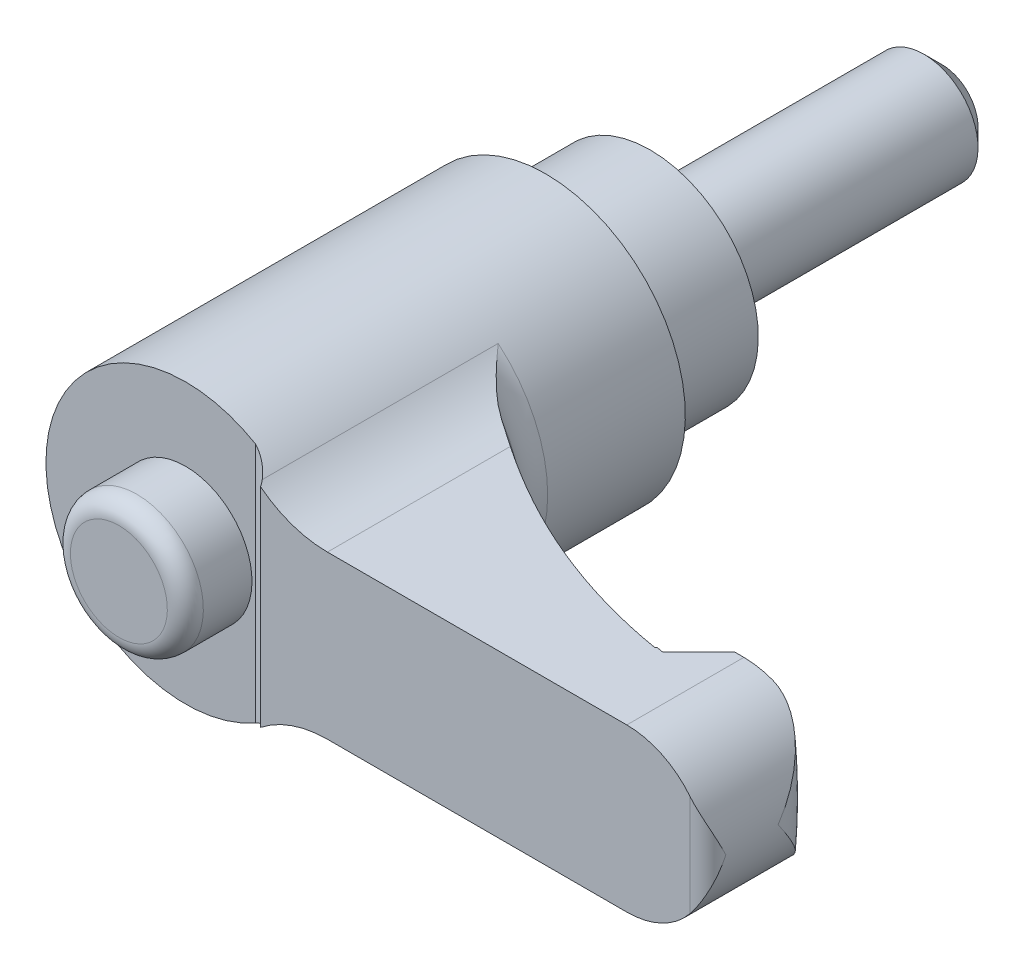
ISO-10303-21;
HEADER;
FILE_DESCRIPTION(('STEP AP214'),'2;1');
FILE_NAME('part.step','',(''),(''),'','','');
FILE_SCHEMA(('AUTOMOTIVE_DESIGN { 1 0 10303 214 1 1 1 1 }'));
ENDSEC;
DATA;
#1=APPLICATION_CONTEXT('core data for automotive mechanical design processes');
#2=APPLICATION_PROTOCOL_DEFINITION('international standard','automotive_design',2000,#1);
#3=PRODUCT_CONTEXT('',#1,'mechanical');
#4=PRODUCT('Part','Part','',(#3));
#5=PRODUCT_RELATED_PRODUCT_CATEGORY('part','',(#4));
#6=PRODUCT_DEFINITION_FORMATION('','',#4);
#7=PRODUCT_DEFINITION_CONTEXT('part definition',#1,'design');
#8=PRODUCT_DEFINITION('design','',#6,#7);
#9=PRODUCT_DEFINITION_SHAPE('','',#8);
#10=(LENGTH_UNIT() NAMED_UNIT(*) SI_UNIT(.MILLI.,.METRE.));
#11=(NAMED_UNIT(*) PLANE_ANGLE_UNIT() SI_UNIT($,.RADIAN.));
#12=(NAMED_UNIT(*) SI_UNIT($,.STERADIAN.) SOLID_ANGLE_UNIT());
#13=UNCERTAINTY_MEASURE_WITH_UNIT(LENGTH_MEASURE(1.E-05),#10,'distance_accuracy_value','');
#14=(GEOMETRIC_REPRESENTATION_CONTEXT(3) GLOBAL_UNCERTAINTY_ASSIGNED_CONTEXT((#13)) GLOBAL_UNIT_ASSIGNED_CONTEXT((#10,
#11,#12)) REPRESENTATION_CONTEXT('',''));
#15=CARTESIAN_POINT('',(0.,0.,0.));
#16=DIRECTION('',(0.,0.,1.));
#17=DIRECTION('',(1.,0.,0.));
#18=AXIS2_PLACEMENT_3D('',#15,#16,#17);
#19=CARTESIAN_POINT('',(4.8,0.,0.));
#20=DIRECTION('',(0.,0.,1.));
#21=DIRECTION('',(0.,-1.,0.));
#22=AXIS2_PLACEMENT_3D('',#19,#20,#21);
#23=PLANE('',#22);
#24=CARTESIAN_POINT('',(0.,0.,0.));
#25=DIRECTION('',(0.,0.,-1.));
#26=DIRECTION('',(0.,1.,0.));
#27=AXIS2_PLACEMENT_3D('',#24,#25,#26);
#28=CIRCLE('',#27,3.);
#29=CARTESIAN_POINT('',(0.,3.,0.));
#30=VERTEX_POINT('',#29);
#31=EDGE_CURVE('E493',#30,#30,#28,.T.);
#32=ORIENTED_EDGE('',*,*,#31,.F.);
#33=EDGE_LOOP('',(#32));
#34=FACE_BOUND('',#33,.T.);
#35=CARTESIAN_POINT('',(0.,0.,0.));
#36=DIRECTION('',(0.,0.,-1.));
#37=DIRECTION('',(0.,1.,0.));
#38=AXIS2_PLACEMENT_3D('',#35,#36,#37);
#39=CIRCLE('',#38,4.8);
#40=CARTESIAN_POINT('',(0.,4.8,0.));
#41=VERTEX_POINT('',#40);
#42=EDGE_CURVE('E433',#41,#41,#39,.T.);
#43=ORIENTED_EDGE('',*,*,#42,.T.);
#44=EDGE_LOOP('',(#43));
#45=FACE_BOUND('',#44,.T.);
#46=ADVANCED_FACE('F14',(#34,#45),#23,.F.);
#47=CARTESIAN_POINT('',(0.,0.,26.));
#48=DIRECTION('',(0.,0.,-1.));
#49=DIRECTION('',(0.,1.,0.));
#50=AXIS2_PLACEMENT_3D('',#47,#48,#49);
#51=PLANE('',#50);
#52=CARTESIAN_POINT('',(0.,0.,26.));
#53=DIRECTION('',(0.,0.,-1.));
#54=DIRECTION('',(0.,1.,0.));
#55=AXIS2_PLACEMENT_3D('',#52,#53,#54);
#56=CIRCLE('',#55,7.75);
#57=CARTESIAN_POINT('',(3.875,-6.7116968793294,26.));
#58=VERTEX_POINT('',#57);
#59=CARTESIAN_POINT('',(3.875,6.7116968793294,26.));
#60=VERTEX_POINT('',#59);
#61=EDGE_CURVE('E380',#58,#60,#56,.T.);
#62=ORIENTED_EDGE('',*,*,#61,.F.);
#63=DIRECTION('',(0.,1.,0.));
#64=VECTOR('',#63,1.);
#65=CARTESIAN_POINT('',(3.875,-9.,26.));
#66=LINE('',#65,#64);
#67=EDGE_CURVE('E467',#58,#60,#66,.T.);
#68=ORIENTED_EDGE('',*,*,#67,.T.);
#69=EDGE_LOOP('',(#62,#68));
#70=FACE_BOUND('',#69,.T.);
#71=CARTESIAN_POINT('',(0.,0.,26.));
#72=DIRECTION('',(0.,0.,-1.));
#73=DIRECTION('',(0.,1.,0.));
#74=AXIS2_PLACEMENT_3D('',#71,#72,#73);
#75=CIRCLE('',#74,3.69047619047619);
#76=CARTESIAN_POINT('',(0.,3.69047619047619,26.));
#77=VERTEX_POINT('',#76);
#78=EDGE_CURVE('E188',#77,#77,#75,.F.);
#79=ORIENTED_EDGE('',*,*,#78,.F.);
#80=EDGE_LOOP('',(#79));
#81=FACE_BOUND('',#80,.T.);
#82=ADVANCED_FACE('F163',(#70,#81),#51,.F.);
#83=CARTESIAN_POINT('',(25.5,0.,0.));
#84=DIRECTION('',(0.,0.,1.));
#85=DIRECTION('',(0.,-1.,0.));
#86=AXIS2_PLACEMENT_3D('',#83,#84,#85);
#87=CYLINDRICAL_SURFACE('',#86,4.5);
#88=CARTESIAN_POINT('',(30.,0.,23.1));
#89=CARTESIAN_POINT('',(30.0000000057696,-0.00397224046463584,23.0972162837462));
#90=CARTESIAN_POINT('',(29.9999947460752,-0.00794462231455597,23.0944324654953));
#91=CARTESIAN_POINT('',(29.9991779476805,-0.316207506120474,22.8784039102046));
#92=CARTESIAN_POINT('',(29.967472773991,-0.621260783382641,22.6646232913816));
#93=CARTESIAN_POINT('',(29.8729566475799,-1.07288244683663,22.3499400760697));
#94=CARTESIAN_POINT('',(29.8335087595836,-1.2227001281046,22.2458576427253));
#95=CARTESIAN_POINT('',(29.7386099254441,-1.51933949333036,22.0407893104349));
#96=CARTESIAN_POINT('',(29.6831664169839,-1.6661625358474,21.9398019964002));
#97=CARTESIAN_POINT('',(29.5225221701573,-2.0316181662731,21.690355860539));
#98=CARTESIAN_POINT('',(29.4064726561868,-2.24755940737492,21.5447545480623));
#99=CARTESIAN_POINT('',(29.1349908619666,-2.66429651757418,21.2699985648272));
#100=CARTESIAN_POINT('',(28.9796468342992,-2.86512503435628,21.1408080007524));
#101=CARTESIAN_POINT('',(28.6740094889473,-3.19567948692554,20.9378778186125));
#102=CARTESIAN_POINT('',(28.5328529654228,-3.3303385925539,20.8584463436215));
#103=CARTESIAN_POINT('',(28.2285136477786,-3.58389708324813,20.7186599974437));
#104=CARTESIAN_POINT('',(28.0653563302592,-3.70281438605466,20.6582833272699));
#105=CARTESIAN_POINT('',(27.7569268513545,-3.89637158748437,20.5739705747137));
#106=CARTESIAN_POINT('',(27.6155988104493,-3.97499958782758,20.5449430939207));
#107=CARTESIAN_POINT('',(27.3962983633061,-4.08175109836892,20.516319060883));
#108=CARTESIAN_POINT('',(27.3219652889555,-4.11547521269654,20.5092639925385));
#109=CARTESIAN_POINT('',(27.1713145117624,-4.17892025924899,20.5006475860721));
#110=CARTESIAN_POINT('',(27.0949977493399,-4.20864304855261,20.4990836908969));
#111=CARTESIAN_POINT('',(26.940135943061,-4.26413478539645,20.5019689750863));
#112=CARTESIAN_POINT('',(26.8615759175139,-4.28985895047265,20.5064814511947));
#113=CARTESIAN_POINT('',(26.7037978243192,-4.33677756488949,20.5220962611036));
#114=CARTESIAN_POINT('',(26.624580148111,-4.35797453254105,20.5331949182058));
#115=CARTESIAN_POINT('',(26.4663684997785,-4.39576374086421,20.5623470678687));
#116=CARTESIAN_POINT('',(26.3873744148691,-4.41235899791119,20.5803959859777));
#117=CARTESIAN_POINT('',(26.230581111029,-4.44101436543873,20.6236628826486));
#118=CARTESIAN_POINT('',(26.1527814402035,-4.4530762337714,20.6488780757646));
#119=CARTESIAN_POINT('',(25.9747863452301,-4.47604389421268,20.7158088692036));
#120=CARTESIAN_POINT('',(25.8753706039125,-4.48535121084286,20.7602222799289));
#121=CARTESIAN_POINT('',(25.7308199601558,-4.4943380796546,20.836059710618));
#122=CARTESIAN_POINT('',(25.6833620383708,-4.49650441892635,20.8629005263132));
#123=CARTESIAN_POINT('',(25.5902043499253,-4.4993369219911,20.9195771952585));
#124=CARTESIAN_POINT('',(25.5445050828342,-4.50000266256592,20.9494138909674));
#125=CARTESIAN_POINT('',(25.4998,-4.49999999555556,20.980704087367));
#126=B_SPLINE_CURVE_WITH_KNOTS('',3,(#88,#89,#90,#91,#92,#93,#94,#95,#96,#97,#98,#99,#100,#101,
#102,#103,#104,#105,#106,#107,#108,#109,#110,#111,#112,#113,#114,#115,#116,#117,#118,#119,#120,
#121,#122,#123,#124,#125),.UNSPECIFIED.,.F.,.F.,(4,2,2,2,2,2,2,2,2,2,2,2,2,2,2,2,2,2,4),(0.,
0.0145521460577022,1.12923174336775,1.68863416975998,2.24777690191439,3.0999476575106,
3.95022123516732,4.58000022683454,5.20905610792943,5.69992949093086,5.94545977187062,
6.19087570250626,6.43886797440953,6.68672193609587,6.93441304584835,7.18200801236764,
7.50864895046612,7.67223429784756,7.83586577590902),.UNSPECIFIED.);
#127=CARTESIAN_POINT('',(27.0737254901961,-4.21584962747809,20.5));
#128=VERTEX_POINT('',#127);
#129=CARTESIAN_POINT('',(30.,0.,23.1));
#130=VERTEX_POINT('',#129);
#131=EDGE_CURVE('E133',#128,#130,#126,.F.);
#132=ORIENTED_EDGE('',*,*,#131,.T.);
#133=CARTESIAN_POINT('',(30.,0.,23.1));
#134=CARTESIAN_POINT('',(30.0000000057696,0.00397224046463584,23.0972162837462));
#135=CARTESIAN_POINT('',(29.9999947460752,0.00794462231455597,23.0944324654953));
#136=CARTESIAN_POINT('',(29.9991779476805,0.316207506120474,22.8784039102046));
#137=CARTESIAN_POINT('',(29.967472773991,0.621260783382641,22.6646232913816));
#138=CARTESIAN_POINT('',(29.8729566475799,1.07288244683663,22.3499400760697));
#139=CARTESIAN_POINT('',(29.8335087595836,1.2227001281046,22.2458576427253));
#140=CARTESIAN_POINT('',(29.7386099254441,1.51933949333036,22.0407893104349));
#141=CARTESIAN_POINT('',(29.6831664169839,1.6661625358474,21.9398019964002));
#142=CARTESIAN_POINT('',(29.5225221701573,2.0316181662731,21.690355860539));
#143=CARTESIAN_POINT('',(29.4064726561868,2.24755940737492,21.5447545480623));
#144=CARTESIAN_POINT('',(29.1349908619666,2.66429651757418,21.2699985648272));
#145=CARTESIAN_POINT('',(28.9796468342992,2.86512503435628,21.1408080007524));
#146=CARTESIAN_POINT('',(28.6740094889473,3.19567948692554,20.9378778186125));
#147=CARTESIAN_POINT('',(28.5328529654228,3.3303385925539,20.8584463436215));
#148=CARTESIAN_POINT('',(28.2285136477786,3.58389708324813,20.7186599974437));
#149=CARTESIAN_POINT('',(28.0653563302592,3.70281438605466,20.6582833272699));
#150=CARTESIAN_POINT('',(27.7569268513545,3.89637158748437,20.5739705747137));
#151=CARTESIAN_POINT('',(27.6155988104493,3.97499958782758,20.5449430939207));
#152=CARTESIAN_POINT('',(27.3962983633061,4.08175109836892,20.516319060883));
#153=CARTESIAN_POINT('',(27.3219652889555,4.11547521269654,20.5092639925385));
#154=CARTESIAN_POINT('',(27.1713145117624,4.17892025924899,20.5006475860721));
#155=CARTESIAN_POINT('',(27.0949977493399,4.20864304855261,20.4990836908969));
#156=CARTESIAN_POINT('',(26.940135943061,4.26413478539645,20.5019689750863));
#157=CARTESIAN_POINT('',(26.8615759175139,4.28985895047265,20.5064814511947));
#158=CARTESIAN_POINT('',(26.7037978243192,4.33677756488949,20.5220962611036));
#159=CARTESIAN_POINT('',(26.624580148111,4.35797453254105,20.5331949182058));
#160=CARTESIAN_POINT('',(26.4663684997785,4.39576374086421,20.5623470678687));
#161=CARTESIAN_POINT('',(26.3873744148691,4.41235899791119,20.5803959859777));
#162=CARTESIAN_POINT('',(26.230581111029,4.44101436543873,20.6236628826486));
#163=CARTESIAN_POINT('',(26.1527814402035,4.4530762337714,20.6488780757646));
#164=CARTESIAN_POINT('',(25.9747863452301,4.47604389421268,20.7158088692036));
#165=CARTESIAN_POINT('',(25.8753706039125,4.48535121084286,20.7602222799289));
#166=CARTESIAN_POINT('',(25.7308199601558,4.4943380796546,20.836059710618));
#167=CARTESIAN_POINT('',(25.6833620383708,4.49650441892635,20.8629005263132));
#168=CARTESIAN_POINT('',(25.5902043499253,4.4993369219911,20.9195771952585));
#169=CARTESIAN_POINT('',(25.5445050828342,4.50000266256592,20.9494138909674));
#170=CARTESIAN_POINT('',(25.4998,4.49999999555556,20.980704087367));
#171=B_SPLINE_CURVE_WITH_KNOTS('',3,(#133,#134,#135,#136,#137,#138,#139,#140,#141,#142,#143,
#144,#145,#146,#147,#148,#149,#150,#151,#152,#153,#154,#155,#156,#157,#158,#159,#160,#161,#162,
#163,#164,#165,#166,#167,#168,#169,#170),.UNSPECIFIED.,.F.,.F.,(4,2,2,2,2,2,2,2,2,2,2,2,2,2,2,2,
2,2,4),(0.,0.0145521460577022,1.12923174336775,1.68863416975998,2.24777690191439,
3.0999476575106,3.95022123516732,4.58000022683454,5.20905610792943,5.69992949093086,
5.94545977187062,6.19087570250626,6.43886797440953,6.68672193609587,6.93441304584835,
7.18200801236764,7.50864895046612,7.67223429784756,7.83586577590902),.UNSPECIFIED.);
#172=CARTESIAN_POINT('',(27.0737254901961,4.21584962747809,20.5));
#173=VERTEX_POINT('',#172);
#174=EDGE_CURVE('E130',#130,#173,#171,.T.);
#175=ORIENTED_EDGE('',*,*,#174,.T.);
#176=CARTESIAN_POINT('',(25.5,0.,20.5));
#177=DIRECTION('',(0.,0.,-1.));
#178=DIRECTION('',(0.,1.,0.));
#179=AXIS2_PLACEMENT_3D('',#176,#177,#178);
#180=CIRCLE('',#179,4.5);
#181=CARTESIAN_POINT('',(25.5,4.5,20.5));
#182=VERTEX_POINT('',#181);
#183=EDGE_CURVE('E405',#173,#182,#180,.F.);
#184=ORIENTED_EDGE('',*,*,#183,.T.);
#185=DIRECTION('',(0.,0.,1.));
#186=VECTOR('',#185,1.);
#187=CARTESIAN_POINT('',(25.5,4.5,0.));
#188=LINE('',#187,#186);
#189=CARTESIAN_POINT('',(25.5,4.5,27.));
#190=VERTEX_POINT('',#189);
#191=EDGE_CURVE('E404',#182,#190,#188,.T.);
#192=ORIENTED_EDGE('',*,*,#191,.T.);
#193=CARTESIAN_POINT('',(25.5,0.,27.));
#194=DIRECTION('',(0.,0.,1.));
#195=DIRECTION('',(0.,-1.,0.));
#196=AXIS2_PLACEMENT_3D('',#193,#194,#195);
#197=CIRCLE('',#196,4.5);
#198=CARTESIAN_POINT('',(29.,2.82842712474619,27.));
#199=VERTEX_POINT('',#198);
#200=EDGE_CURVE('E383',#199,#190,#197,.T.);
#201=ORIENTED_EDGE('',*,*,#200,.F.);
#202=CARTESIAN_POINT('',(29.,2.82842712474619,27.));
#203=CARTESIAN_POINT('',(29.0452569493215,2.77244060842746,26.9999705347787));
#204=CARTESIAN_POINT('',(29.08910814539,2.71541373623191,26.9969310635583));
#205=CARTESIAN_POINT('',(29.1737346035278,2.59976408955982,26.9857221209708));
#206=CARTESIAN_POINT('',(29.2145155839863,2.54114457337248,26.9775624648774));
#207=CARTESIAN_POINT('',(29.2926216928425,2.42301598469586,26.9570723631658));
#208=CARTESIAN_POINT('',(29.3299701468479,2.36351669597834,26.9447732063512));
#209=CARTESIAN_POINT('',(29.4015263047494,2.24343051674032,26.9166544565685));
#210=CARTESIAN_POINT('',(29.4357319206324,2.18284293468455,26.9008325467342));
#211=CARTESIAN_POINT('',(29.5205149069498,2.0242761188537,26.8558925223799));
#212=CARTESIAN_POINT('',(29.5686353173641,1.92562477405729,26.8244847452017));
#213=CARTESIAN_POINT('',(29.6569408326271,1.7267576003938,26.7560098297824));
#214=CARTESIAN_POINT('',(29.6971228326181,1.62654117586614,26.7189404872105));
#215=CARTESIAN_POINT('',(29.769924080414,1.42454335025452,26.6403878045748));
#216=CARTESIAN_POINT('',(29.8025090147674,1.32275698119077,26.5988856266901));
#217=CARTESIAN_POINT('',(29.8600923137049,1.1184186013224,26.5127603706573));
#218=CARTESIAN_POINT('',(29.8850925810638,1.0158667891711,26.4681380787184));
#219=CARTESIAN_POINT('',(29.9373931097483,0.763467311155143,26.3559210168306));
#220=CARTESIAN_POINT('',(29.9605764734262,0.613303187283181,26.2871011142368));
#221=CARTESIAN_POINT('',(29.9916507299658,0.312779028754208,26.1474204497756));
#222=CARTESIAN_POINT('',(29.999578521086,0.162420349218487,26.0765650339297));
#223=CARTESIAN_POINT('',(29.9999945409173,0.00809034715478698,26.0038138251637));
#224=CARTESIAN_POINT('',(29.999999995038,0.00404514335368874,26.0019068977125));
#225=CARTESIAN_POINT('',(30.,0.,26.));
#226=B_SPLINE_CURVE_WITH_KNOTS('',3,(#202,#203,#204,#205,#206,#207,#208,#209,#210,#211,#212,
#213,#214,#215,#216,#217,#218,#219,#220,#221,#222,#223,#224,#225),.UNSPECIFIED.,.F.,.F.,(4,2,2,
2,2,2,2,2,2,2,2,4),(0.,0.215782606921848,0.431152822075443,0.644930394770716,0.858848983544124,
1.20082332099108,1.5429311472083,1.88655545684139,2.23009348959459,2.7297347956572,
3.22816610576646,3.2415825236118),.UNSPECIFIED.);
#227=CARTESIAN_POINT('',(30.,0.,26.));
#228=VERTEX_POINT('',#227);
#229=EDGE_CURVE('E174',#228,#199,#226,.F.);
#230=ORIENTED_EDGE('',*,*,#229,.F.);
#231=CARTESIAN_POINT('',(29.,-2.82842712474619,27.));
#232=CARTESIAN_POINT('',(29.0452569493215,-2.77244060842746,26.9999705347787));
#233=CARTESIAN_POINT('',(29.08910814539,-2.71541373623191,26.9969310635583));
#234=CARTESIAN_POINT('',(29.1737346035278,-2.59976408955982,26.9857221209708));
#235=CARTESIAN_POINT('',(29.2145155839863,-2.54114457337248,26.9775624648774));
#236=CARTESIAN_POINT('',(29.2926216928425,-2.42301598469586,26.9570723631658));
#237=CARTESIAN_POINT('',(29.3299701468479,-2.36351669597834,26.9447732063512));
#238=CARTESIAN_POINT('',(29.4015263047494,-2.24343051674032,26.9166544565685));
#239=CARTESIAN_POINT('',(29.4357319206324,-2.18284293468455,26.9008325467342));
#240=CARTESIAN_POINT('',(29.5205149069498,-2.0242761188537,26.8558925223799));
#241=CARTESIAN_POINT('',(29.5686353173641,-1.92562477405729,26.8244847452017));
#242=CARTESIAN_POINT('',(29.6569408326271,-1.7267576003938,26.7560098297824));
#243=CARTESIAN_POINT('',(29.6971228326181,-1.62654117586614,26.7189404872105));
#244=CARTESIAN_POINT('',(29.769924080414,-1.42454335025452,26.6403878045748));
#245=CARTESIAN_POINT('',(29.8025090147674,-1.32275698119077,26.5988856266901));
#246=CARTESIAN_POINT('',(29.8600923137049,-1.1184186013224,26.5127603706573));
#247=CARTESIAN_POINT('',(29.8850925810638,-1.0158667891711,26.4681380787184));
#248=CARTESIAN_POINT('',(29.9373931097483,-0.763467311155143,26.3559210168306));
#249=CARTESIAN_POINT('',(29.9605764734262,-0.613303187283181,26.2871011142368));
#250=CARTESIAN_POINT('',(29.9916507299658,-0.312779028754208,26.1474204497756));
#251=CARTESIAN_POINT('',(29.999578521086,-0.162420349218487,26.0765650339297));
#252=CARTESIAN_POINT('',(29.9999945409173,-0.00809034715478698,26.0038138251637));
#253=CARTESIAN_POINT('',(29.999999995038,-0.00404514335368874,26.0019068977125));
#254=CARTESIAN_POINT('',(30.,0.,26.));
#255=B_SPLINE_CURVE_WITH_KNOTS('',3,(#231,#232,#233,#234,#235,#236,#237,#238,#239,#240,#241,
#242,#243,#244,#245,#246,#247,#248,#249,#250,#251,#252,#253,#254),.UNSPECIFIED.,.F.,.F.,(4,2,2,
2,2,2,2,2,2,2,2,4),(0.,0.215782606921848,0.431152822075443,0.644930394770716,0.858848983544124,
1.20082332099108,1.5429311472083,1.88655545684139,2.23009348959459,2.7297347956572,
3.22816610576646,3.2415825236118),.UNSPECIFIED.);
#256=CARTESIAN_POINT('',(29.,-2.82842712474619,27.));
#257=VERTEX_POINT('',#256);
#258=EDGE_CURVE('E182',#257,#228,#255,.T.);
#259=ORIENTED_EDGE('',*,*,#258,.F.);
#260=CARTESIAN_POINT('',(25.5,-4.5,27.));
#261=VERTEX_POINT('',#260);
#262=EDGE_CURVE('E389',#261,#257,#197,.T.);
#263=ORIENTED_EDGE('',*,*,#262,.F.);
#264=DIRECTION('',(0.,0.,1.));
#265=VECTOR('',#264,1.);
#266=CARTESIAN_POINT('',(25.5,-4.5,0.));
#267=LINE('',#266,#265);
#268=CARTESIAN_POINT('',(25.5,-4.5,20.5));
#269=VERTEX_POINT('',#268);
#270=EDGE_CURVE('E409',#269,#261,#267,.T.);
#271=ORIENTED_EDGE('',*,*,#270,.F.);
#272=EDGE_CURVE('E140',#269,#128,#180,.F.);
#273=ORIENTED_EDGE('',*,*,#272,.T.);
#274=EDGE_LOOP('',(#132,#175,#184,#192,#201,#230,#259,#263,#271,#273));
#275=FACE_BOUND('',#274,.T.);
#276=ADVANCED_FACE('F138',(#275),#87,.T.);
#277=CARTESIAN_POINT('',(28.072410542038,-9.,-7.06806810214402));
#278=DIRECTION('',(0.,1.,0.));
#279=DIRECTION('',(-1.,0.,0.));
#280=AXIS2_PLACEMENT_3D('',#277,#278,#279);
#281=CYLINDRICAL_SURFACE('',#280,30.);
#282=CARTESIAN_POINT('',(22.457864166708,5.40076351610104,22.4018635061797));
#283=CARTESIAN_POINT('',(22.5328704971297,5.02783315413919,22.4161416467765));
#284=CARTESIAN_POINT('',(22.6003478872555,4.65331694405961,22.4287120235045));
#285=CARTESIAN_POINT('',(22.7199001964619,3.90172149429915,22.4506465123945));
#286=CARTESIAN_POINT('',(22.7719742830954,3.52464211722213,22.4600104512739));
#287=CARTESIAN_POINT('',(22.860391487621,2.76836181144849,22.4757441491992));
#288=CARTESIAN_POINT('',(22.8967259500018,2.38915983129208,22.4821122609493));
#289=CARTESIAN_POINT('',(22.953399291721,1.62955869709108,22.4919810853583));
#290=CARTESIAN_POINT('',(22.9737386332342,1.24915957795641,22.4954818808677));
#291=CARTESIAN_POINT('',(23.0101209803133,0.119914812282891,22.5017516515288));
#292=CARTESIAN_POINT('',(23.0030278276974,-0.62982701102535,22.5005458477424));
#293=CARTESIAN_POINT('',(22.9265280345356,-2.12549757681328,22.487326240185));
#294=CARTESIAN_POINT('',(22.8571649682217,-2.87142861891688,22.4753199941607));
#295=CARTESIAN_POINT('',(22.717445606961,-3.91200869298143,22.450161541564));
#296=CARTESIAN_POINT('',(22.6723784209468,-4.21035002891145,22.4419679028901));
#297=CARTESIAN_POINT('',(22.5724363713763,-4.80637536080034,22.4235048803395));
#298=CARTESIAN_POINT('',(22.5175283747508,-5.10405358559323,22.4132284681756));
#299=CARTESIAN_POINT('',(22.457864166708,-5.40076351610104,22.4018635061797));
#300=B_SPLINE_CURVE_WITH_KNOTS('',3,(#282,#283,#284,#285,#286,#287,#288,#289,#290,#291,#292,
#293,#294,#295,#296,#297,#298,#299),.UNSPECIFIED.,.F.,.F.,(4,2,2,2,2,2,2,2,4),(0.,
1.14192528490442,2.28391227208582,3.4265264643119,4.56910763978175,6.81558260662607,
9.06048679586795,9.96586555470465,10.8743519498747),.UNSPECIFIED.);
#301=CARTESIAN_POINT('',(23.,0.,22.5));
#302=VERTEX_POINT('',#301);
#303=CARTESIAN_POINT('',(22.6238084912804,-4.5,22.4329951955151));
#304=VERTEX_POINT('',#303);
#305=EDGE_CURVE('E136',#302,#304,#300,.T.);
#306=ORIENTED_EDGE('',*,*,#305,.F.);
#307=DIRECTION('',(0.,1.,0.));
#308=VECTOR('',#307,1.);
#309=CARTESIAN_POINT('',(23.,-9.,22.5));
#310=LINE('',#309,#308);
#311=CARTESIAN_POINT('',(23.,-4.5,22.5));
#312=VERTEX_POINT('',#311);
#313=EDGE_CURVE('E473',#312,#302,#310,.T.);
#314=ORIENTED_EDGE('',*,*,#313,.F.);
#315=CARTESIAN_POINT('',(28.072410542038,-4.5,-7.06806810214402));
#316=DIRECTION('',(0.,1.,0.));
#317=DIRECTION('',(-1.,0.,0.));
#318=AXIS2_PLACEMENT_3D('',#315,#316,#317);
#319=CIRCLE('',#318,30.);
#320=EDGE_CURVE('E464',#312,#304,#319,.F.);
#321=ORIENTED_EDGE('',*,*,#320,.T.);
#322=EDGE_LOOP('',(#306,#314,#321));
#323=FACE_BOUND('',#322,.T.);
#324=ADVANCED_FACE('F162',(#323),#281,.F.);
#325=CARTESIAN_POINT('',(27.4,-9.,20.5));
#326=DIRECTION('',(0.,0.,-1.));
#327=DIRECTION('',(0.,1.,0.));
#328=AXIS2_PLACEMENT_3D('',#325,#326,#327);
#329=PLANE('',#328);
#330=ORIENTED_EDGE('',*,*,#183,.F.);
#331=CARTESIAN_POINT('',(0.,0.,20.5));
#332=DIRECTION('',(0.,0.,-1.));
#333=DIRECTION('',(0.,1.,0.));
#334=AXIS2_PLACEMENT_3D('',#331,#332,#333);
#335=CIRCLE('',#334,27.4);
#336=EDGE_CURVE('E37',#173,#128,#335,.T.);
#337=ORIENTED_EDGE('',*,*,#336,.T.);
#338=ORIENTED_EDGE('',*,*,#272,.F.);
#339=DIRECTION('',(-1.,0.,0.));
#340=VECTOR('',#339,1.);
#341=CARTESIAN_POINT('',(25.5,-4.5,20.5));
#342=LINE('',#341,#340);
#343=CARTESIAN_POINT('',(25.,-4.5,20.5));
#344=VERTEX_POINT('',#343);
#345=EDGE_CURVE('E540',#269,#344,#342,.T.);
#346=ORIENTED_EDGE('',*,*,#345,.T.);
#347=DIRECTION('',(0.,1.,0.));
#348=VECTOR('',#347,1.);
#349=CARTESIAN_POINT('',(25.,-9.,20.5));
#350=LINE('',#349,#348);
#351=CARTESIAN_POINT('',(25.,4.5,20.5));
#352=VERTEX_POINT('',#351);
#353=EDGE_CURVE('E460',#344,#352,#350,.T.);
#354=ORIENTED_EDGE('',*,*,#353,.T.);
#355=DIRECTION('',(1.,0.,0.));
#356=VECTOR('',#355,1.);
#357=CARTESIAN_POINT('',(8.87764045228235,4.5,20.5));
#358=LINE('',#357,#356);
#359=EDGE_CURVE('E419',#352,#182,#358,.T.);
#360=ORIENTED_EDGE('',*,*,#359,.T.);
#361=EDGE_LOOP('',(#330,#337,#338,#346,#354,#360));
#362=FACE_BOUND('',#361,.T.);
#363=ADVANCED_FACE('F196',(#362),#329,.T.);
#364=CARTESIAN_POINT('',(0.,0.,27.));
#365=DIRECTION('',(0.,0.,1.));
#366=DIRECTION('',(0.,-1.,0.));
#367=AXIS2_PLACEMENT_3D('',#364,#365,#366);
#368=PLANE('',#367);
#369=CARTESIAN_POINT('',(8.87764045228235,10.5,27.));
#370=DIRECTION('',(0.,0.,1.));
#371=DIRECTION('',(1.,0.,0.));
#372=AXIS2_PLACEMENT_3D('',#369,#370,#371);
#373=CIRCLE('',#372,6.);
#374=CARTESIAN_POINT('',(5.16666666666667,5.78527057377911,27.));
#375=VERTEX_POINT('',#374);
#376=CARTESIAN_POINT('',(8.87764045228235,4.5,27.));
#377=VERTEX_POINT('',#376);
#378=EDGE_CURVE('E414',#375,#377,#373,.T.);
#379=ORIENTED_EDGE('',*,*,#378,.F.);
#380=DIRECTION('',(0.,1.,0.));
#381=VECTOR('',#380,1.);
#382=CARTESIAN_POINT('',(5.16666666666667,-9.,27.));
#383=LINE('',#382,#381);
#384=CARTESIAN_POINT('',(5.16666666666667,-5.78527057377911,27.));
#385=VERTEX_POINT('',#384);
#386=EDGE_CURVE('E453',#385,#375,#383,.T.);
#387=ORIENTED_EDGE('',*,*,#386,.F.);
#388=CARTESIAN_POINT('',(8.87764045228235,-10.5,27.));
#389=DIRECTION('',(0.,0.,1.));
#390=DIRECTION('',(1.,0.,0.));
#391=AXIS2_PLACEMENT_3D('',#388,#389,#390);
#392=CIRCLE('',#391,6.);
#393=CARTESIAN_POINT('',(8.87764045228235,-4.5,27.));
#394=VERTEX_POINT('',#393);
#395=EDGE_CURVE('E417',#394,#385,#392,.T.);
#396=ORIENTED_EDGE('',*,*,#395,.F.);
#397=DIRECTION('',(-1.,0.,0.));
#398=VECTOR('',#397,1.);
#399=CARTESIAN_POINT('',(25.5,-4.5,27.));
#400=LINE('',#399,#398);
#401=EDGE_CURVE('E413',#261,#394,#400,.T.);
#402=ORIENTED_EDGE('',*,*,#401,.F.);
#403=ORIENTED_EDGE('',*,*,#262,.T.);
#404=DIRECTION('',(0.,1.,0.));
#405=VECTOR('',#404,1.);
#406=CARTESIAN_POINT('',(29.,-9.,27.));
#407=LINE('',#406,#405);
#408=EDGE_CURVE('E401',#257,#199,#407,.T.);
#409=ORIENTED_EDGE('',*,*,#408,.T.);
#410=ORIENTED_EDGE('',*,*,#200,.T.);
#411=DIRECTION('',(1.,0.,0.));
#412=VECTOR('',#411,1.);
#413=CARTESIAN_POINT('',(8.87764045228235,4.5,27.));
#414=LINE('',#413,#412);
#415=EDGE_CURVE('E400',#377,#190,#414,.T.);
#416=ORIENTED_EDGE('',*,*,#415,.F.);
#417=EDGE_LOOP('',(#379,#387,#396,#402,#403,#409,#410,#416));
#418=FACE_BOUND('',#417,.T.);
#419=ADVANCED_FACE('F244',(#418),#368,.T.);
#420=CARTESIAN_POINT('',(0.,0.,0.));
#421=DIRECTION('',(0.,0.,-1.));
#422=DIRECTION('',(0.,1.,0.));
#423=AXIS2_PLACEMENT_3D('',#420,#421,#422);
#424=CYLINDRICAL_SURFACE('',#423,7.75);
#425=CARTESIAN_POINT('',(0.,0.,13.6426560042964));
#426=DIRECTION('',(0.,0.,-1.));
#427=DIRECTION('',(0.,1.,0.));
#428=AXIS2_PLACEMENT_3D('',#425,#426,#427);
#429=CIRCLE('',#428,7.75);
#430=CARTESIAN_POINT('',(5.00376098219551,5.91818181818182,13.6426560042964));
#431=VERTEX_POINT('',#430);
#432=CARTESIAN_POINT('',(5.00376098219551,-5.91818181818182,13.6426560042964));
#433=VERTEX_POINT('',#432);
#434=EDGE_CURVE('E374',#431,#433,#429,.T.);
#435=ORIENTED_EDGE('',*,*,#434,.T.);
#436=DIRECTION('',(0.,0.,1.));
#437=VECTOR('',#436,1.);
#438=CARTESIAN_POINT('',(5.00376098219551,-5.91818181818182,0.));
#439=LINE('',#438,#437);
#440=CARTESIAN_POINT('',(5.00376098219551,-5.91818181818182,26.7442638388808));
#441=VERTEX_POINT('',#440);
#442=EDGE_CURVE('E425',#433,#441,#439,.T.);
#443=ORIENTED_EDGE('',*,*,#442,.T.);
#444=CARTESIAN_POINT('',(3.875,-6.7116968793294,26.));
#445=CARTESIAN_POINT('',(3.9487248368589,-6.66914880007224,26.0179048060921));
#446=CARTESIAN_POINT('',(4.02097408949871,-6.62579988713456,26.039874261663));
#447=CARTESIAN_POINT('',(4.16199829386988,-6.53812669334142,26.0915573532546));
#448=CARTESIAN_POINT('',(4.23077434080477,-6.49380272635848,26.1212685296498));
#449=CARTESIAN_POINT('',(4.36202505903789,-6.40634475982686,26.1868862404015));
#450=CARTESIAN_POINT('',(4.42463632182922,-6.36322379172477,26.2225378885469));
#451=CARTESIAN_POINT('',(4.54579687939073,-6.27724013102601,26.3004737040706));
#452=CARTESIAN_POINT('',(4.60434578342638,-6.23437746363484,26.3427585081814));
#453=CARTESIAN_POINT('',(4.71026264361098,-6.1546555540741,26.4283893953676));
#454=CARTESIAN_POINT('',(4.75813291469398,-6.11768751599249,26.4710140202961));
#455=CARTESIAN_POINT('',(4.8500303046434,-6.04509175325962,26.56120031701));
#456=CARTESIAN_POINT('',(4.89405965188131,-6.00946325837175,26.6087590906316));
#457=CARTESIAN_POINT('',(4.97925799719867,-5.9390764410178,26.7103994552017));
#458=CARTESIAN_POINT('',(5.02029084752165,-5.90438218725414,26.7646407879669));
#459=CARTESIAN_POINT('',(5.09738332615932,-5.83796295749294,26.8783962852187));
#460=CARTESIAN_POINT('',(5.13343386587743,-5.80624344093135,26.9379197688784));
#461=CARTESIAN_POINT('',(5.16666666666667,-5.77650894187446,27.));
#462=B_SPLINE_CURVE_WITH_KNOTS('',3,(#444,#445,#446,#447,#448,#449,#450,#451,#452,#453,#454,
#455,#456,#457,#458,#459,#460,#461),.UNSPECIFIED.,.F.,.F.,(4,2,2,2,2,2,2,2,4),(0.,
0.260811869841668,0.521540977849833,0.773092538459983,1.02466826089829,1.24638864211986,
1.4679795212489,1.69664297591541,1.92571819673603),.UNSPECIFIED.);
#463=EDGE_CURVE('E218',#58,#441,#462,.T.);
#464=ORIENTED_EDGE('',*,*,#463,.F.);
#465=ORIENTED_EDGE('',*,*,#61,.T.);
#466=CARTESIAN_POINT('',(5.16666666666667,5.77650894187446,27.));
#467=CARTESIAN_POINT('',(5.13714077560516,5.80292379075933,26.9448365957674));
#468=CARTESIAN_POINT('',(5.1053831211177,5.83091583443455,26.8916890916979));
#469=CARTESIAN_POINT('',(5.03785941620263,5.88934998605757,26.7895453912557));
#470=CARTESIAN_POINT('',(5.00209830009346,5.91978906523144,26.7405442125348));
#471=CARTESIAN_POINT('',(4.92700880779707,5.98243056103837,26.646752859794));
#472=CARTESIAN_POINT('',(4.88768622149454,6.01463008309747,26.6019560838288));
#473=CARTESIAN_POINT('',(4.80573825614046,6.08030777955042,26.5165060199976));
#474=CARTESIAN_POINT('',(4.76311181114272,6.11378636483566,26.4758540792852));
#475=CARTESIAN_POINT('',(4.63114473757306,6.21507952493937,26.3605779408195));
#476=CARTESIAN_POINT('',(4.53728284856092,6.28411879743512,26.2920994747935));
#477=CARTESIAN_POINT('',(4.3393749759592,6.42237347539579,26.1724069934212));
#478=CARTESIAN_POINT('',(4.23533663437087,6.49158871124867,26.1211801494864));
#479=CARTESIAN_POINT('',(4.08621326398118,6.5854168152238,26.0632790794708));
#480=CARTESIAN_POINT('',(4.04469277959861,6.61100425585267,26.0487072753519));
#481=CARTESIAN_POINT('',(3.96061680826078,6.66171281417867,26.0222973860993));
#482=CARTESIAN_POINT('',(3.91806319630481,6.68683464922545,26.0104547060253));
#483=CARTESIAN_POINT('',(3.8750000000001,6.7116968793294,26.));
#484=B_SPLINE_CURVE_WITH_KNOTS('',3,(#466,#467,#468,#469,#470,#471,#472,#473,#474,#475,#476,
#477,#478,#479,#480,#481,#482,#483),.UNSPECIFIED.,.F.,.F.,(4,2,2,2,2,2,2,2,4),(0.,
0.203583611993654,0.406919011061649,0.609929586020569,0.813005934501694,1.21684507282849,
1.62038324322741,1.77301957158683,1.9253970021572),.UNSPECIFIED.);
#485=CARTESIAN_POINT('',(5.0037609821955,5.91818181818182,26.7442638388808));
#486=VERTEX_POINT('',#485);
#487=EDGE_CURVE('E232',#486,#60,#484,.T.);
#488=ORIENTED_EDGE('',*,*,#487,.F.);
#489=DIRECTION('',(0.,0.,1.));
#490=VECTOR('',#489,1.);
#491=CARTESIAN_POINT('',(5.00376098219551,5.91818181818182,0.));
#492=LINE('',#491,#490);
#493=EDGE_CURVE('E431',#431,#486,#492,.T.);
#494=ORIENTED_EDGE('',*,*,#493,.F.);
#495=EDGE_LOOP('',(#435,#443,#464,#465,#488,#494));
#496=FACE_BOUND('',#495,.T.);
#497=CARTESIAN_POINT('',(0.,0.,6.));
#498=DIRECTION('',(0.,0.,-1.));
#499=DIRECTION('',(0.,1.,0.));
#500=AXIS2_PLACEMENT_3D('',#497,#498,#499);
#501=CIRCLE('',#500,7.75);
#502=CARTESIAN_POINT('',(0.,7.75,6.));
#503=VERTEX_POINT('',#502);
#504=EDGE_CURVE('E378',#503,#503,#501,.T.);
#505=ORIENTED_EDGE('',*,*,#504,.F.);
#506=EDGE_LOOP('',(#505));
#507=FACE_BOUND('',#506,.T.);
#508=ADVANCED_FACE('F242',(#496,#507),#424,.T.);
#509=CARTESIAN_POINT('',(8.87764045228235,10.5,0.));
#510=DIRECTION('',(0.,0.,1.));
#511=DIRECTION('',(0.,-1.,0.));
#512=AXIS2_PLACEMENT_3D('',#509,#510,#511);
#513=CYLINDRICAL_SURFACE('',#512,6.);
#514=DIRECTION('',(0.,0.,1.));
#515=VECTOR('',#514,1.);
#516=CARTESIAN_POINT('',(8.87764045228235,4.5,0.));
#517=LINE('',#516,#515);
#518=CARTESIAN_POINT('',(8.87764045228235,4.5,16.8419191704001));
#519=VERTEX_POINT('',#518);
#520=EDGE_CURVE('E408',#519,#377,#517,.T.);
#521=ORIENTED_EDGE('',*,*,#520,.F.);
#522=CARTESIAN_POINT('',(8.87784045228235,4.50000000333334,16.8420543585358));
#523=CARTESIAN_POINT('',(8.76298675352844,4.50000678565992,16.7644412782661));
#524=CARTESIAN_POINT('',(8.64795886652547,4.50329006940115,16.687069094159));
#525=CARTESIAN_POINT('',(8.41786670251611,4.51653249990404,16.5336144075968));
#526=CARTESIAN_POINT('',(8.30280331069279,4.52647413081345,16.457529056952));
#527=CARTESIAN_POINT('',(8.07233993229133,4.55315590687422,16.3070362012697));
#528=CARTESIAN_POINT('',(7.95693991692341,4.56989665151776,16.2326288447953));
#529=CARTESIAN_POINT('',(7.72548993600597,4.61048878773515,16.0861329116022));
#530=CARTESIAN_POINT('',(7.60943905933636,4.63435875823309,16.0140509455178));
#531=CARTESIAN_POINT('',(7.49320434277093,4.66190641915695,15.9436475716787));
#532=B_SPLINE_CURVE_WITH_KNOTS('',3,(#522,#523,#524,#525,#526,#527,#528,#529,#530,#531),
.UNSPECIFIED.,.F.,.F.,(4,2,2,2,4),(0.,0.415830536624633,0.830571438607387,1.24534891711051,
1.66121688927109),.UNSPECIFIED.);
#533=CARTESIAN_POINT('',(7.49353468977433,4.66182809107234,15.9438475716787));
#534=VERTEX_POINT('',#533);
#535=EDGE_CURVE('E258',#519,#534,#532,.T.);
#536=ORIENTED_EDGE('',*,*,#535,.T.);
#537=CARTESIAN_POINT('',(7.49386505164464,4.66174977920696,15.9440475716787));
#538=CARTESIAN_POINT('',(7.41534599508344,4.68036361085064,15.8965108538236));
#539=CARTESIAN_POINT('',(7.33813459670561,4.70033346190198,15.8474028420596));
#540=CARTESIAN_POINT('',(7.18628313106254,4.74278447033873,15.7464454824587));
#541=CARTESIAN_POINT('',(7.11164195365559,4.76526452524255,15.694597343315));
#542=CARTESIAN_POINT('',(6.89171782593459,4.83609524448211,15.5357042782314));
#543=CARTESIAN_POINT('',(6.75010221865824,4.88791699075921,15.4251060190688));
#544=CARTESIAN_POINT('',(6.47674906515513,4.99932791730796,15.1976148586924));
#545=CARTESIAN_POINT('',(6.34496293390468,5.05887426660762,15.0807586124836));
#546=CARTESIAN_POINT('',(6.08952700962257,5.18523508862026,14.8421034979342));
#547=CARTESIAN_POINT('',(5.96588083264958,5.25205275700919,14.7203024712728));
#548=CARTESIAN_POINT('',(5.6959472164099,5.41010140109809,14.4425118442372));
#549=CARTESIAN_POINT('',(5.55174299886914,5.50325599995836,14.2855983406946));
#550=CARTESIAN_POINT('',(5.27355500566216,5.70004368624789,13.9693256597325));
#551=CARTESIAN_POINT('',(5.13957057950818,5.80367610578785,13.8099666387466));
#552=CARTESIAN_POINT('',(5.00807252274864,5.91453907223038,13.6479722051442));
#553=CARTESIAN_POINT('',(5.00591610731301,5.91635969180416,13.6453140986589));
#554=CARTESIAN_POINT('',(5.00376098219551,5.91818181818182,13.6426560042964));
#555=B_SPLINE_CURVE_WITH_KNOTS('',3,(#537,#538,#539,#540,#541,#542,#543,#544,#545,#546,#547,
#548,#549,#550,#551,#552,#553,#554),.UNSPECIFIED.,.F.,.F.,(4,2,2,2,2,2,2,2,4),(0.,
0.280888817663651,0.561654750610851,1.12199628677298,1.67935400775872,2.2369576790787,
2.93418472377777,3.63136735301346,3.6429980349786),.UNSPECIFIED.);
#556=EDGE_CURVE('E249',#534,#431,#555,.T.);
#557=ORIENTED_EDGE('',*,*,#556,.T.);
#558=ORIENTED_EDGE('',*,*,#493,.T.);
#559=CARTESIAN_POINT('',(5.16666666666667,5.78527057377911,27.));
#560=CARTESIAN_POINT('',(5.1544362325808,5.79489712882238,26.9771411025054));
#561=CARTESIAN_POINT('',(5.14182657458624,5.80489933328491,26.9546446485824));
#562=CARTESIAN_POINT('',(5.11593353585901,5.82561925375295,26.910451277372));
#563=CARTESIAN_POINT('',(5.10265156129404,5.83633549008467,26.8887528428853));
#564=CARTESIAN_POINT('',(5.07544919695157,5.85848632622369,26.8461383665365));
#565=CARTESIAN_POINT('',(5.06152881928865,5.86992091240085,26.8252223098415));
#566=CARTESIAN_POINT('',(5.03308032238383,5.89351543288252,26.784152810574));
#567=CARTESIAN_POINT('',(5.0185510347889,5.90567678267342,26.7640009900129));
#568=CARTESIAN_POINT('',(5.0037609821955,5.91818181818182,26.7442638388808));
#569=B_SPLINE_CURVE_WITH_KNOTS('',3,(#559,#560,#561,#562,#563,#564,#565,#566,#567,#568),
.UNSPECIFIED.,.F.,.F.,(4,2,2,2,4),(0.,0.0829550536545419,0.165743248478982,0.248529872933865,
0.331483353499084),.UNSPECIFIED.);
#570=EDGE_CURVE('E226',#375,#486,#569,.T.);
#571=ORIENTED_EDGE('',*,*,#570,.F.);
#572=ORIENTED_EDGE('',*,*,#378,.T.);
#573=EDGE_LOOP('',(#521,#536,#557,#558,#571,#572));
#574=FACE_BOUND('',#573,.T.);
#575=ADVANCED_FACE('F238',(#574),#513,.F.);
#576=CARTESIAN_POINT('',(8.87764045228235,4.5,0.));
#577=DIRECTION('',(0.,-1.,0.));
#578=DIRECTION('',(1.,0.,0.));
#579=AXIS2_PLACEMENT_3D('',#576,#577,#578);
#580=PLANE('',#579);
#581=CARTESIAN_POINT('',(28.072410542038,4.5,-7.06806810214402));
#582=DIRECTION('',(0.,-1.,0.));
#583=DIRECTION('',(1.,0.,0.));
#584=AXIS2_PLACEMENT_3D('',#581,#582,#583);
#585=CIRCLE('',#584,30.);
#586=CARTESIAN_POINT('',(22.6238084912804,4.5,22.432995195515));
#587=VERTEX_POINT('',#586);
#588=CARTESIAN_POINT('',(23.,4.5,22.5));
#589=VERTEX_POINT('',#588);
#590=EDGE_CURVE('E461',#587,#589,#585,.F.);
#591=ORIENTED_EDGE('',*,*,#590,.F.);
#592=CARTESIAN_POINT('',(44.3300735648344,4.5,0.942111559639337));
#593=CARTESIAN_POINT('',(43.4547012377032,4.5,1.81300466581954));
#594=CARTESIAN_POINT('',(42.5792011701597,4.5,2.68376940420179));
#595=CARTESIAN_POINT('',(40.8278840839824,4.5,4.42498033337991));
#596=CARTESIAN_POINT('',(39.9520670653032,4.5,5.29542652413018));
#597=CARTESIAN_POINT('',(37.3240501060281,4.5,7.90619283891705));
#598=CARTESIAN_POINT('',(35.5712829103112,4.5,9.64594205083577));
#599=CARTESIAN_POINT('',(32.0635642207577,4.5,13.1230346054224));
#600=CARTESIAN_POINT('',(30.3086128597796,4.5,14.8603780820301));
#601=CARTESIAN_POINT('',(27.6733297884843,4.5,17.4635089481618));
#602=CARTESIAN_POINT('',(26.7944244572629,4.5,18.3307401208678));
#603=CARTESIAN_POINT('',(25.0353323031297,4.5,20.0639019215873));
#604=CARTESIAN_POINT('',(24.155145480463,4.5,20.9298325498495));
#605=CARTESIAN_POINT('',(22.3129521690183,4.5,22.7385304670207));
#606=CARTESIAN_POINT('',(21.3507796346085,4.5,23.6811286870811));
#607=CARTESIAN_POINT('',(19.4234130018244,4.5,25.5632155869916));
#608=CARTESIAN_POINT('',(18.4582189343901,4.5,26.5027042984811));
#609=CARTESIAN_POINT('',(17.0068469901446,4.5,27.9082821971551));
#610=CARTESIAN_POINT('',(16.5224491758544,4.5,28.3762088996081));
#611=CARTESIAN_POINT('',(15.5521170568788,4.5,29.3104634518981));
#612=CARTESIAN_POINT('',(15.0661827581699,4.5,29.7767913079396));
#613=CARTESIAN_POINT('',(14.0922926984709,4.5,30.7073654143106));
#614=CARTESIAN_POINT('',(13.6043368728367,4.5,31.1716115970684));
#615=CARTESIAN_POINT('',(12.8703741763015,4.5,31.8658425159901));
#616=CARTESIAN_POINT('',(12.625380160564,4.5,32.0968979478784));
#617=CARTESIAN_POINT('',(12.1345901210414,4.5,32.5581570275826));
#618=CARTESIAN_POINT('',(11.8887940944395,4.5,32.7883606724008));
#619=CARTESIAN_POINT('',(11.6425345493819,4.5,33.0180686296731));
#620=B_SPLINE_CURVE_WITH_KNOTS('',3,(#592,#593,#594,#595,#596,#597,#598,#599,#600,#601,#602,
#603,#604,#605,#606,#607,#608,#609,#610,#611,#612,#613,#614,#615,#616,#617,#618,#619),
.UNSPECIFIED.,.F.,.F.,(4,2,2,2,2,2,2,2,2,2,2,2,2,4),(0.,3.70440058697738,7.40880170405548,
14.8175982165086,22.225964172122,25.9301609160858,29.6343569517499,33.6751954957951,
37.7159927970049,39.736477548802,41.7569544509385,43.7774964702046,44.7877808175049,
45.7980687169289),.UNSPECIFIED.);
#621=CARTESIAN_POINT('',(22.55548713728,4.5,22.5));
#622=VERTEX_POINT('',#621);
#623=EDGE_CURVE('E304',#587,#622,#620,.T.);
#624=ORIENTED_EDGE('',*,*,#623,.T.);
#625=CARTESIAN_POINT('',(15.4388208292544,4.5,20.4312501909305));
#626=CARTESIAN_POINT('',(14.9382009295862,4.5,20.2216724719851));
#627=CARTESIAN_POINT('',(14.4426076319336,4.5,19.9999912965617));
#628=CARTESIAN_POINT('',(13.4622769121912,4.5,19.5336725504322));
#629=CARTESIAN_POINT('',(12.9775414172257,4.5,19.2890309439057));
#630=CARTESIAN_POINT('',(12.0194633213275,4.5,18.778303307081));
#631=CARTESIAN_POINT('',(11.5461217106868,4.5,18.5122154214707));
#632=CARTESIAN_POINT('',(10.6110367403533,4.5,17.9604954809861));
#633=CARTESIAN_POINT('',(10.1492927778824,4.5,17.6748644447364));
#634=CARTESIAN_POINT('',(9.23133715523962,4.5,17.0827723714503));
#635=CARTESIAN_POINT('',(8.77526312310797,4.5,16.776098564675));
#636=CARTESIAN_POINT('',(8.09865121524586,4.5,16.3053789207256));
#637=CARTESIAN_POINT('',(7.87435773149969,4.5,16.1466830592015));
#638=CARTESIAN_POINT('',(7.42793360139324,4.5,15.826278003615));
#639=CARTESIAN_POINT('',(7.20580294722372,4.5,15.6645688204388));
#640=CARTESIAN_POINT('',(6.76333109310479,4.5,15.3388557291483));
#641=CARTESIAN_POINT('',(6.54298941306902,4.5,15.1748524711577));
#642=CARTESIAN_POINT('',(6.10341304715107,4.5,14.8453678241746));
#643=CARTESIAN_POINT('',(5.88417837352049,4.5,14.6798864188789));
#644=CARTESIAN_POINT('',(5.44597621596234,4.5,14.3486019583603));
#645=CARTESIAN_POINT('',(5.22700871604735,4.5,14.1827989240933));
#646=CARTESIAN_POINT('',(4.7881475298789,4.5,13.8524268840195));
#647=CARTESIAN_POINT('',(4.56825387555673,4.5,13.6878578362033));
#648=CARTESIAN_POINT('',(4.22599707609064,4.5,13.4359606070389));
#649=CARTESIAN_POINT('',(4.10454867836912,4.5,13.3473935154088));
#650=CARTESIAN_POINT('',(3.86050375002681,4.5,13.1718439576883));
#651=CARTESIAN_POINT('',(3.73790719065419,4.5,13.0848615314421));
#652=CARTESIAN_POINT('',(3.49095051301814,4.5,12.9129975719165));
#653=CARTESIAN_POINT('',(3.36658787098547,4.5,12.8281196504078));
#654=CARTESIAN_POINT('',(3.11579592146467,4.5,12.661467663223));
#655=CARTESIAN_POINT('',(2.98936669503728,4.5,12.5796934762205));
#656=CARTESIAN_POINT('',(2.73559541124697,4.5,12.421447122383));
#657=CARTESIAN_POINT('',(2.60828909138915,4.5,12.3449180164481));
#658=CARTESIAN_POINT('',(2.35045679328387,4.5,12.1973627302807));
#659=CARTESIAN_POINT('',(2.21993005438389,4.5,12.1263378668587));
#660=CARTESIAN_POINT('',(1.95547938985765,4.5,11.9918684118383));
#661=CARTESIAN_POINT('',(1.82156674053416,4.5,11.9284018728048));
#662=CARTESIAN_POINT('',(1.54956725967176,4.5,11.811188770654));
#663=CARTESIAN_POINT('',(1.41148300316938,4.5,11.7574363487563));
#664=CARTESIAN_POINT('',(1.16760292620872,4.5,11.6748301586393));
#665=CARTESIAN_POINT('',(1.06277320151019,4.5,11.6431384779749));
#666=CARTESIAN_POINT('',(0.850970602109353,4.5,11.5877982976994));
#667=CARTESIAN_POINT('',(0.743997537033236,4.5,11.5641505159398));
#668=CARTESIAN_POINT('',(0.528623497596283,4.5,11.5260430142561));
#669=CARTESIAN_POINT('',(0.420225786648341,4.5,11.5115651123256));
#670=CARTESIAN_POINT('',(0.202558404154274,4.5,11.4925018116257));
#671=CARTESIAN_POINT('',(0.0932888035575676,4.5,11.4879156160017));
#672=CARTESIAN_POINT('',(-0.125523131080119,4.5,11.4889012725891));
#673=CARTESIAN_POINT('',(-0.235065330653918,4.5,11.494502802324));
#674=CARTESIAN_POINT('',(-0.453184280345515,4.5,11.5155971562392));
#675=CARTESIAN_POINT('',(-0.561760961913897,4.5,11.5310906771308));
#676=CARTESIAN_POINT('',(-0.777434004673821,4.5,11.5711835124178));
#677=CARTESIAN_POINT('',(-0.884526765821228,4.5,11.5958019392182));
#678=CARTESIAN_POINT('',(-1.09652638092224,4.5,11.653010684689));
#679=CARTESIAN_POINT('',(-1.20143316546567,4.5,11.6856012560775));
#680=CARTESIAN_POINT('',(-1.54299128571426,4.5,11.8040046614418));
#681=CARTESIAN_POINT('',(-1.77469278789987,4.5,11.9041680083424));
#682=CARTESIAN_POINT('',(-2.11370642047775,4.5,12.0712278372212));
#683=CARTESIAN_POINT('',(-2.22542247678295,4.5,12.1298009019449));
#684=CARTESIAN_POINT('',(-2.4464125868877,4.5,12.2514053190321));
#685=CARTESIAN_POINT('',(-2.55568698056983,4.5,12.314436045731));
#686=CARTESIAN_POINT('',(-2.77325410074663,4.5,12.4446206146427));
#687=CARTESIAN_POINT('',(-2.88152520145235,4.5,12.5118101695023));
#688=CARTESIAN_POINT('',(-3.09631836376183,4.5,12.648928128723));
#689=CARTESIAN_POINT('',(-3.20284038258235,4.5,12.7188565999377));
#690=CARTESIAN_POINT('',(-3.41436916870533,4.5,12.8607497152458));
#691=CARTESIAN_POINT('',(-3.51937725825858,4.5,12.9327123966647));
#692=CARTESIAN_POINT('',(-3.72827441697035,4.5,13.0782322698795));
#693=CARTESIAN_POINT('',(-3.83216352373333,4.5,13.1517894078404));
#694=CARTESIAN_POINT('',(-4.05439859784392,4.5,13.3110694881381));
#695=CARTESIAN_POINT('',(-4.17260856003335,4.5,13.3969817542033));
#696=CARTESIAN_POINT('',(-4.4082339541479,4.5,13.5698902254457));
#697=CARTESIAN_POINT('',(-4.52564937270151,4.5,13.6568864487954));
#698=CARTESIAN_POINT('',(-4.87714945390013,4.5,13.9189069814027));
#699=CARTESIAN_POINT('',(-5.11047154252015,4.5,14.094951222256));
#700=CARTESIAN_POINT('',(-5.57685056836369,4.5,14.4474717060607));
#701=CARTESIAN_POINT('',(-5.80990745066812,4.5,14.6239480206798));
#702=CARTESIAN_POINT('',(-6.27690523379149,4.5,14.9757283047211));
#703=CARTESIAN_POINT('',(-6.51084612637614,4.5,15.1510322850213));
#704=CARTESIAN_POINT('',(-6.98047432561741,4.5,15.4993223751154));
#705=CARTESIAN_POINT('',(-7.21616173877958,4.5,15.6723083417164));
#706=CARTESIAN_POINT('',(-7.68986343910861,4.5,16.0150746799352));
#707=CARTESIAN_POINT('',(-7.92787774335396,4.5,16.1848550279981));
#708=CARTESIAN_POINT('',(-8.40663111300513,4.5,16.5205040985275));
#709=CARTESIAN_POINT('',(-8.64736999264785,4.5,16.6863730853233));
#710=CARTESIAN_POINT('',(-9.13186171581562,4.5,17.0136492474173));
#711=CARTESIAN_POINT('',(-9.37561458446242,4.5,17.1750563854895));
#712=CARTESIAN_POINT('',(-10.1060893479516,4.5,17.6482368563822));
#713=CARTESIAN_POINT('',(-10.5975021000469,4.5,17.952835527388));
#714=CARTESIAN_POINT('',(-11.5934664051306,4.5,18.5398125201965));
#715=CARTESIAN_POINT('',(-12.0980184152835,4.5,18.8221900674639));
#716=CARTESIAN_POINT('',(-13.1203636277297,4.5,19.362665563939));
#717=CARTESIAN_POINT('',(-13.6381640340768,4.5,19.6207499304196));
#718=CARTESIAN_POINT('',(-14.6860430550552,4.5,20.11066531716));
#719=CARTESIAN_POINT('',(-15.2161220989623,4.5,20.3424954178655));
#720=CARTESIAN_POINT('',(-16.5720374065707,4.5,20.8941289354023));
#721=CARTESIAN_POINT('',(-17.4055454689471,4.5,21.1953302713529));
#722=CARTESIAN_POINT('',(-19.0940463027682,4.5,21.7283556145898));
#723=CARTESIAN_POINT('',(-19.9490297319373,4.5,21.960209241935));
#724=CARTESIAN_POINT('',(-21.6811099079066,4.5,22.3529309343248));
#725=CARTESIAN_POINT('',(-22.5583149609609,4.5,22.5133231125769));
#726=CARTESIAN_POINT('',(-24.3233745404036,4.5,22.7586307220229));
#727=CARTESIAN_POINT('',(-25.2112306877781,4.5,22.8435345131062));
#728=CARTESIAN_POINT('',(-26.9908314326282,4.5,22.9363918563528));
#729=CARTESIAN_POINT('',(-27.8825753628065,4.5,22.9443581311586));
#730=CARTESIAN_POINT('',(-29.663358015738,4.5,22.8827217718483));
#731=CARTESIAN_POINT('',(-30.5523968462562,4.5,22.8131222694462));
#732=CARTESIAN_POINT('',(-32.31901432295,4.5,22.5966903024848));
#733=CARTESIAN_POINT('',(-33.1966141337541,4.5,22.4500307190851));
#734=CARTESIAN_POINT('',(-34.935590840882,4.5,22.080370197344));
#735=CARTESIAN_POINT('',(-35.796967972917,4.5,21.8573703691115));
#736=CARTESIAN_POINT('',(-37.4685359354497,4.5,21.3451591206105));
#737=CARTESIAN_POINT('',(-38.2794766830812,4.5,21.0583920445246));
#738=CARTESIAN_POINT('',(-39.873960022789,4.5,20.4167921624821));
#739=CARTESIAN_POINT('',(-40.6575033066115,4.5,20.0619610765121));
#740=CARTESIAN_POINT('',(-42.1918635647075,4.5,19.2864593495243));
#741=CARTESIAN_POINT('',(-42.9426616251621,4.5,18.8657512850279));
#742=CARTESIAN_POINT('',(-44.4054978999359,4.5,17.9616153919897));
#743=CARTESIAN_POINT('',(-45.1175362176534,4.5,17.4781877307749));
#744=CARTESIAN_POINT('',(-46.4882343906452,4.5,16.4590216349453));
#745=CARTESIAN_POINT('',(-47.1474852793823,4.5,15.9240778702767));
#746=CARTESIAN_POINT('',(-48.4183395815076,4.5,14.8003122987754));
#747=CARTESIAN_POINT('',(-49.0299435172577,4.5,14.2114910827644));
#748=CARTESIAN_POINT('',(-50.2009517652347,4.5,12.9842748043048));
#749=CARTESIAN_POINT('',(-50.7603665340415,4.5,12.3458897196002));
#750=CARTESIAN_POINT('',(-51.8230723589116,4.5,11.0239977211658));
#751=CARTESIAN_POINT('',(-52.3263634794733,4.5,10.3404908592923));
#752=CARTESIAN_POINT('',(-53.2706922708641,4.5,8.93692421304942));
#753=CARTESIAN_POINT('',(-53.7120407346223,4.5,8.21707350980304));
#754=CARTESIAN_POINT('',(-54.532396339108,4.5,6.74268654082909));
#755=CARTESIAN_POINT('',(-54.9114037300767,4.5,5.98815041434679));
#756=CARTESIAN_POINT('',(-55.6043575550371,4.5,4.44974284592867));
#757=CARTESIAN_POINT('',(-55.9183019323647,4.5,3.66587047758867));
#758=CARTESIAN_POINT('',(-56.478850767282,4.5,2.07440645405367));
#759=CARTESIAN_POINT('',(-56.7254552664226,4.5,1.26681481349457));
#760=CARTESIAN_POINT('',(-57.14904744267,4.5,-0.364399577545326));
#761=CARTESIAN_POINT('',(-57.3261971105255,4.5,-1.18798026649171));
#762=CARTESIAN_POINT('',(-57.6104293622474,4.5,-2.84714412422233));
#763=CARTESIAN_POINT('',(-57.7175120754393,4.5,-3.68272727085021));
#764=CARTESIAN_POINT('',(-57.8608403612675,4.5,-5.35993452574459));
#765=CARTESIAN_POINT('',(-57.8970869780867,4.5,-6.20155854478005));
#766=CARTESIAN_POINT('',(-57.8984858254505,4.5,-7.8848657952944));
#767=CARTESIAN_POINT('',(-57.8636380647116,4.5,-8.72654902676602));
#768=CARTESIAN_POINT('',(-57.7231579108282,4.5,-10.4032722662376));
#769=CARTESIAN_POINT('',(-57.6175852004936,4.5,-11.2383172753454));
#770=CARTESIAN_POINT('',(-57.3364725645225,4.5,-12.8965453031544));
#771=CARTESIAN_POINT('',(-57.1609326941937,4.5,-13.7197283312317));
#772=CARTESIAN_POINT('',(-56.7411440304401,4.5,-15.348385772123));
#773=CARTESIAN_POINT('',(-56.4968951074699,4.5,-16.1538601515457));
#774=CARTESIAN_POINT('',(-55.9414392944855,4.5,-17.7413808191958));
#775=CARTESIAN_POINT('',(-55.6302323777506,4.5,-18.5234270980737));
#776=CARTESIAN_POINT('',(-54.9430163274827,4.5,-20.0587116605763));
#777=CARTESIAN_POINT('',(-54.5669932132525,4.5,-20.8119436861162));
#778=CARTESIAN_POINT('',(-53.7528854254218,4.5,-22.28408588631));
#779=CARTESIAN_POINT('',(-53.3148007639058,4.5,-23.0029960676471));
#780=CARTESIAN_POINT('',(-52.3797121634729,4.5,-24.4014049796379));
#781=CARTESIAN_POINT('',(-51.8827089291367,4.5,-25.0809041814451));
#782=CARTESIAN_POINT('',(-50.8333343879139,4.5,-26.3957112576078));
#783=CARTESIAN_POINT('',(-50.2809630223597,4.5,-27.0310190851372));
#784=CARTESIAN_POINT('',(-49.1240210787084,4.5,-28.2538041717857));
#785=CARTESIAN_POINT('',(-48.519381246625,4.5,-28.841215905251));
#786=CARTESIAN_POINT('',(-47.2628697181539,4.5,-29.9631382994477));
#787=CARTESIAN_POINT('',(-46.6109980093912,4.5,-30.4976489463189));
#788=CARTESIAN_POINT('',(-45.2646445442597,4.5,-31.5100756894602));
#789=CARTESIAN_POINT('',(-44.5701605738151,4.5,-31.9879888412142));
#790=CARTESIAN_POINT('',(-43.1435639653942,4.5,-32.8838941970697));
#791=CARTESIAN_POINT('',(-42.4114512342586,4.5,-33.3018862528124));
#792=CARTESIAN_POINT('',(-40.912331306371,4.5,-34.0763837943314));
#793=CARTESIAN_POINT('',(-40.145216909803,4.5,-34.4326817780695));
#794=CARTESIAN_POINT('',(-38.5838228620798,4.5,-35.0797120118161));
#795=CARTESIAN_POINT('',(-37.7895432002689,4.5,-35.3704442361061));
#796=CARTESIAN_POINT('',(-36.1796169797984,4.5,-35.884414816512));
#797=CARTESIAN_POINT('',(-35.3639746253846,4.5,-36.1076663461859));
#798=CARTESIAN_POINT('',(-33.7169153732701,4.5,-36.485403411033));
#799=CARTESIAN_POINT('',(-32.8854983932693,4.5,-36.6398885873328));
#800=CARTESIAN_POINT('',(-31.2068509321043,4.5,-36.8801373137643));
#801=CARTESIAN_POINT('',(-30.3595503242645,4.5,-36.9654093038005));
#802=CARTESIAN_POINT('',(-28.6606960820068,4.5,-37.0651578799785));
#803=CARTESIAN_POINT('',(-27.8091424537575,4.5,-37.0796345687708));
#804=CARTESIAN_POINT('',(-26.5330536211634,4.5,-37.0485559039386));
#805=CARTESIAN_POINT('',(-26.107715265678,4.5,-37.0293778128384));
#806=CARTESIAN_POINT('',(-25.2581880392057,4.5,-36.9735158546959));
#807=CARTESIAN_POINT('',(-24.8339991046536,4.5,-36.9368329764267));
#808=CARTESIAN_POINT('',(-23.9875137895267,4.5,-36.8461059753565));
#809=CARTESIAN_POINT('',(-23.5652172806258,4.5,-36.7920630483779));
#810=CARTESIAN_POINT('',(-22.7231096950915,4.5,-36.6668007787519));
#811=CARTESIAN_POINT('',(-22.3032991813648,4.5,-36.5955776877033));
#812=CARTESIAN_POINT('',(-21.0326362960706,4.5,-36.3534077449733));
#813=CARTESIAN_POINT('',(-20.1867400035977,4.5,-36.1556925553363));
#814=CARTESIAN_POINT('',(-18.5137717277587,4.5,-35.6923115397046));
#815=CARTESIAN_POINT('',(-17.6867009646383,4.5,-35.4266413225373));
#816=CARTESIAN_POINT('',(-16.4648122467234,4.5,-34.9802120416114));
#817=CARTESIAN_POINT('',(-16.0610185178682,4.5,-34.8235901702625));
#818=CARTESIAN_POINT('',(-15.2598672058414,4.5,-34.494886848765));
#819=CARTESIAN_POINT('',(-14.8625080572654,4.5,-34.3228092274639));
#820=CARTESIAN_POINT('',(-14.0745563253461,4.5,-33.9637665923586));
#821=CARTESIAN_POINT('',(-13.6839641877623,4.5,-33.7768006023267));
#822=CARTESIAN_POINT('',(-12.909871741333,4.5,-33.3886824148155));
#823=CARTESIAN_POINT('',(-12.5263717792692,4.5,-33.1875295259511));
#824=CARTESIAN_POINT('',(-11.8207248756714,4.5,-32.801439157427));
#825=CARTESIAN_POINT('',(-11.4976102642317,4.5,-32.6182650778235));
#826=CARTESIAN_POINT('',(-10.8567820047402,4.5,-32.2426997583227));
#827=CARTESIAN_POINT('',(-10.539068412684,4.5,-32.0503084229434));
#828=CARTESIAN_POINT('',(-9.90902430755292,4.5,-31.6570700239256));
#829=CARTESIAN_POINT('',(-9.59669262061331,4.5,-31.4562248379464));
#830=CARTESIAN_POINT('',(-8.97708038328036,4.5,-31.0468984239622));
#831=CARTESIAN_POINT('',(-8.66979986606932,4.5,-30.838417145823));
#832=CARTESIAN_POINT('',(-8.05909926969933,4.5,-30.414391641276));
#833=CARTESIAN_POINT('',(-7.75568987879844,4.5,-30.1988320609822));
#834=CARTESIAN_POINT('',(-7.15264493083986,4.5,-29.7624945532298));
#835=CARTESIAN_POINT('',(-6.853009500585,4.5,-29.5417164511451));
#836=CARTESIAN_POINT('',(-6.25625428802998,4.5,-29.0968095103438));
#837=CARTESIAN_POINT('',(-5.95913448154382,4.5,-28.8726807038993));
#838=CARTESIAN_POINT('',(-5.51381007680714,4.5,-28.5360257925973));
#839=CARTESIAN_POINT('',(-5.36542874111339,4.5,-28.4237312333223));
#840=CARTESIAN_POINT('',(-5.06841921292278,4.5,-28.199468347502));
#841=CARTESIAN_POINT('',(-4.91979102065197,4.5,-28.0875000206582));
#842=CARTESIAN_POINT('',(-4.6673759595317,4.5,-27.8985569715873));
#843=CARTESIAN_POINT('',(-4.56376685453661,4.5,-27.8213455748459));
#844=CARTESIAN_POINT('',(-4.35603430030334,4.5,-27.6676191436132));
#845=CARTESIAN_POINT('',(-4.25191084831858,4.5,-27.5911041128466));
#846=CARTESIAN_POINT('',(-3.93839628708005,4.5,-27.3629654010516));
#847=CARTESIAN_POINT('',(-3.72792755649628,4.5,-27.2127984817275));
#848=CARTESIAN_POINT('',(-3.40866330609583,4.5,-26.9930527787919));
#849=CARTESIAN_POINT('',(-3.30173041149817,4.5,-26.920774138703));
#850=CARTESIAN_POINT('',(-3.08629576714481,4.5,-26.7785997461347));
#851=CARTESIAN_POINT('',(-2.97779412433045,4.5,-26.7087038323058));
#852=CARTESIAN_POINT('',(-2.75891564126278,4.5,-26.5720402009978));
#853=CARTESIAN_POINT('',(-2.64853991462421,4.5,-26.5052707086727));
#854=CARTESIAN_POINT('',(-2.42546973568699,4.5,-26.3757336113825));
#855=CARTESIAN_POINT('',(-2.31277560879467,4.5,-26.3129654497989));
#856=CARTESIAN_POINT('',(-2.08830306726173,4.5,-26.1944953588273));
#857=CARTESIAN_POINT('',(-1.97661068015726,4.5,-26.1386316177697));
#858=CARTESIAN_POINT('',(-1.75033429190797,4.5,-26.0330124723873));
#859=CARTESIAN_POINT('',(-1.63575004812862,4.5,-25.9832575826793));
#860=CARTESIAN_POINT('',(-1.40370429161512,4.5,-25.8914945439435));
#861=CARTESIAN_POINT('',(-1.28624783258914,4.5,-25.8494737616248));
#862=CARTESIAN_POINT('',(-1.04839229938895,4.5,-25.7748468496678));
#863=CARTESIAN_POINT('',(-0.927994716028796,4.5,-25.7422360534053));
#864=CARTESIAN_POINT('',(-0.704765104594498,4.5,-25.6926144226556));
#865=CARTESIAN_POINT('',(-0.602309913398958,4.5,-25.6739180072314));
#866=CARTESIAN_POINT('',(-0.396192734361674,4.5,-25.6451371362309));
#867=CARTESIAN_POINT('',(-0.292530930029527,4.5,-25.6350513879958));
#868=CARTESIAN_POINT('',(-0.0849035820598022,4.5,-25.6240115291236));
#869=CARTESIAN_POINT('',(0.0190610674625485,4.5,-25.6230408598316));
#870=CARTESIAN_POINT('',(0.226677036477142,4.5,-25.6302356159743));
#871=CARTESIAN_POINT('',(0.330328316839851,4.5,-25.6384021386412));
#872=CARTESIAN_POINT('',(0.558826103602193,4.5,-25.6661714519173));
#873=CARTESIAN_POINT('',(0.683419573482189,4.5,-25.687861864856));
#874=CARTESIAN_POINT('',(0.930070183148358,4.5,-25.7427051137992));
#875=CARTESIAN_POINT('',(1.05212589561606,4.5,-25.7758642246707));
#876=CARTESIAN_POINT('',(1.29373096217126,4.5,-25.8519835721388));
#877=CARTESIAN_POINT('',(1.41326576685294,4.5,-25.8949893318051));
#878=CARTESIAN_POINT('',(1.64912618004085,4.5,-25.9888630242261));
#879=CARTESIAN_POINT('',(1.76545261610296,4.5,-26.0397289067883));
#880=CARTESIAN_POINT('',(2.08022955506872,4.5,-26.1876658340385));
#881=CARTESIAN_POINT('',(2.27569357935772,4.5,-26.291055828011));
#882=CARTESIAN_POINT('',(2.65965824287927,4.5,-26.510129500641));
#883=CARTESIAN_POINT('',(2.84815185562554,4.5,-26.6258251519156));
#884=CARTESIAN_POINT('',(3.2206264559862,4.5,-26.865464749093));
#885=CARTESIAN_POINT('',(3.40459103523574,4.5,-26.9894339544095));
#886=CARTESIAN_POINT('',(3.76897708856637,4.5,-27.2422768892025));
#887=CARTESIAN_POINT('',(3.94939990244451,4.5,-27.3711487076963));
#888=CARTESIAN_POINT('',(4.30959038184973,4.5,-27.6329175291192));
#889=CARTESIAN_POINT('',(4.48934008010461,4.5,-27.7658391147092));
#890=CARTESIAN_POINT('',(4.84769993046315,4.5,-28.0332268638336));
#891=CARTESIAN_POINT('',(5.02631000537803,4.5,-28.1676931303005));
#892=CARTESIAN_POINT('',(5.38285547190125,4.5,-28.4368710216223));
#893=CARTESIAN_POINT('',(5.56079149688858,4.5,-28.5715818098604));
#894=CARTESIAN_POINT('',(5.91689994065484,4.5,-28.8406969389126));
#895=CARTESIAN_POINT('',(6.09507236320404,4.5,-28.9751012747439));
#896=CARTESIAN_POINT('',(6.51845290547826,4.5,-29.2927601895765));
#897=CARTESIAN_POINT('',(6.76396770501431,4.5,-29.4756076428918));
#898=CARTESIAN_POINT('',(7.25717026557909,4.5,-29.8383539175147));
#899=CARTESIAN_POINT('',(7.50485801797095,4.5,-30.0182527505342));
#900=CARTESIAN_POINT('',(8.00299141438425,4.5,-30.374186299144));
#901=CARTESIAN_POINT('',(8.25343697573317,4.5,-30.550221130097));
#902=CARTESIAN_POINT('',(8.75748514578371,4.5,-30.8977104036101));
#903=CARTESIAN_POINT('',(9.01108777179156,4.5,-31.0691648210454));
#904=CARTESIAN_POINT('',(9.77721510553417,4.5,-31.5758563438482));
#905=CARTESIAN_POINT('',(10.2949280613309,4.5,-31.9033270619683));
#906=CARTESIAN_POINT('',(11.3450798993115,4.5,-32.5338451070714));
#907=CARTESIAN_POINT('',(11.877519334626,4.5,-32.8368915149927));
#908=CARTESIAN_POINT('',(12.9541574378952,4.5,-33.4143106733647));
#909=CARTESIAN_POINT('',(13.4982794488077,4.5,-33.6888259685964));
#910=CARTESIAN_POINT('',(14.6002432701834,4.5,-34.2088544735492));
#911=CARTESIAN_POINT('',(15.1580853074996,4.5,-34.454367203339));
#912=CARTESIAN_POINT('',(16.286390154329,4.5,-34.9146730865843));
#913=CARTESIAN_POINT('',(16.8568541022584,4.5,-35.1294634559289));
#914=CARTESIAN_POINT('',(18.0088078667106,4.5,-35.5268449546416));
#915=CARTESIAN_POINT('',(18.5902966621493,4.5,-35.7094390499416));
#916=CARTESIAN_POINT('',(20.0165260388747,4.5,-36.1130976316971));
#917=CARTESIAN_POINT('',(20.8663068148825,4.5,-36.3166227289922));
#918=CARTESIAN_POINT('',(22.5794989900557,4.5,-36.652424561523));
#919=CARTESIAN_POINT('',(23.4429056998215,4.5,-36.7847252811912));
#920=CARTESIAN_POINT('',(25.1788937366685,4.5,-36.9764824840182));
#921=CARTESIAN_POINT('',(26.0514851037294,4.5,-37.0358485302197));
#922=CARTESIAN_POINT('',(27.7986551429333,4.5,-37.0803209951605));
#923=CARTESIAN_POINT('',(28.6732340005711,4.5,-37.0654201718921));
#924=CARTESIAN_POINT('',(30.4186265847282,4.5,-36.9608997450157));
#925=CARTESIAN_POINT('',(31.289436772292,4.5,-36.8712208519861));
#926=CARTESIAN_POINT('',(33.0201174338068,4.5,-36.6173414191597));
#927=CARTESIAN_POINT('',(33.8799881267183,4.5,-36.4531423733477));
#928=CARTESIAN_POINT('',(35.5821003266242,4.5,-36.0512093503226));
#929=CARTESIAN_POINT('',(36.4243470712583,4.5,-35.8134975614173));
#930=CARTESIAN_POINT('',(38.0851095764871,4.5,-35.266073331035));
#931=CARTESIAN_POINT('',(38.9036256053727,4.5,-34.9563617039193));
#932=CARTESIAN_POINT('',(40.4925929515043,4.5,-34.274865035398));
#933=CARTESIAN_POINT('',(41.2637115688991,4.5,-33.904634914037));
#934=CARTESIAN_POINT('',(42.7716979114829,4.5,-33.0999949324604));
#935=CARTESIAN_POINT('',(43.5085661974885,4.5,-32.6655861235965));
#936=CARTESIAN_POINT('',(44.9426667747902,4.5,-31.7356321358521));
#937=CARTESIAN_POINT('',(45.6398987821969,4.5,-31.2400865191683));
#938=CARTESIAN_POINT('',(46.9896031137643,4.5,-30.1913841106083));
#939=CARTESIAN_POINT('',(47.6420755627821,4.5,-29.6382274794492));
#940=CARTESIAN_POINT('',(48.891363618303,4.5,-28.4839074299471));
#941=CARTESIAN_POINT('',(49.4886578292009,4.5,-27.8832618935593));
#942=CARTESIAN_POINT('',(50.6303244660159,4.5,-26.6336248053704));
#943=CARTESIAN_POINT('',(51.1746972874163,4.5,-25.9846336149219));
#944=CARTESIAN_POINT('',(52.2065665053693,4.5,-24.642944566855));
#945=CARTESIAN_POINT('',(52.6940648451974,4.5,-23.9502482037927));
#946=CARTESIAN_POINT('',(53.6086759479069,4.5,-22.5260740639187));
#947=CARTESIAN_POINT('',(54.0357887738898,4.5,-21.7945963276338));
#948=CARTESIAN_POINT('',(54.8249218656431,4.5,-20.3011453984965));
#949=CARTESIAN_POINT('',(55.1872000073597,4.5,-19.5393084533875));
#950=CARTESIAN_POINT('',(55.8461836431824,4.5,-17.9877847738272));
#951=CARTESIAN_POINT('',(56.1428893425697,4.5,-17.1980981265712));
#952=CARTESIAN_POINT('',(56.668591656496,4.5,-15.5965045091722));
#953=CARTESIAN_POINT('',(56.8975886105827,4.5,-14.7845976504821));
#954=CARTESIAN_POINT('',(57.2862265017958,4.5,-13.144350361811));
#955=CARTESIAN_POINT('',(57.4458674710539,4.5,-12.3160099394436));
#956=CARTESIAN_POINT('',(57.6944225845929,4.5,-10.6502902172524));
#957=CARTESIAN_POINT('',(57.783461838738,4.5,-9.81292958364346));
#958=CARTESIAN_POINT('',(57.8906458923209,4.5,-8.13368390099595));
#959=CARTESIAN_POINT('',(57.9087907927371,4.5,-7.29179885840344));
#960=CARTESIAN_POINT('',(57.8740561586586,4.5,-5.60950140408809));
#961=CARTESIAN_POINT('',(57.8211771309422,4.5,-4.76908898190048));
#962=CARTESIAN_POINT('',(57.6447751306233,4.5,-3.09571117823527));
#963=CARTESIAN_POINT('',(57.5212521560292,4.5,-2.26274579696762));
#964=CARTESIAN_POINT('',(57.2045280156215,4.5,-0.610600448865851));
#965=CARTESIAN_POINT('',(57.0113616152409,4.5,0.208586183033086));
#966=CARTESIAN_POINT('',(56.5567261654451,4.5,1.82778068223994));
#967=CARTESIAN_POINT('',(56.2952571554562,4.5,2.6277885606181));
#968=CARTESIAN_POINT('',(55.7058883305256,4.5,4.2029541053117));
#969=CARTESIAN_POINT('',(55.3779880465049,4.5,4.97811159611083));
#970=CARTESIAN_POINT('',(54.6581068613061,4.5,6.49807652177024));
#971=CARTESIAN_POINT('',(54.2661259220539,4.5,7.24288393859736));
#972=CARTESIAN_POINT('',(53.4206580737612,4.5,8.69727722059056));
#973=CARTESIAN_POINT('',(52.9671375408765,4.5,9.40684353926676));
#974=CARTESIAN_POINT('',(52.002004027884,4.5,10.7853008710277));
#975=CARTESIAN_POINT('',(51.490391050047,4.5,11.4541918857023));
#976=CARTESIAN_POINT('',(50.4127466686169,4.5,12.7465698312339));
#977=CARTESIAN_POINT('',(49.8467165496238,4.5,13.3700578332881));
#978=CARTESIAN_POINT('',(48.6642736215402,4.5,14.5672713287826));
#979=CARTESIAN_POINT('',(48.0478607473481,4.5,15.1409967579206));
#980=CARTESIAN_POINT('',(46.7678900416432,4.5,16.2356730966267));
#981=CARTESIAN_POINT('',(46.1042486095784,4.5,16.7565262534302));
#982=CARTESIAN_POINT('',(44.7355620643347,4.5,17.7406453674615));
#983=CARTESIAN_POINT('',(44.0305169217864,4.5,18.2039112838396));
#984=CARTESIAN_POINT('',(42.5840120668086,4.5,19.0696922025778));
#985=CARTESIAN_POINT('',(41.8425502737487,4.5,19.47220372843));
#986=CARTESIAN_POINT('',(40.3285253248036,4.5,20.2137163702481));
#987=CARTESIAN_POINT('',(39.5559621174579,4.5,20.5527173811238));
#988=CARTESIAN_POINT('',(37.9819561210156,4.5,21.1662345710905));
#989=CARTESIAN_POINT('',(37.1804070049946,4.5,21.4404779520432));
#990=CARTESIAN_POINT('',(35.5571683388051,4.5,21.9209115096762));
#991=CARTESIAN_POINT('',(34.7354786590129,4.5,22.1271012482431));
#992=CARTESIAN_POINT('',(33.0778123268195,4.5,22.4701993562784));
#993=CARTESIAN_POINT('',(32.2418364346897,4.5,22.607111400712));
#994=CARTESIAN_POINT('',(30.5614263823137,4.5,22.8110090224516));
#995=CARTESIAN_POINT('',(29.7169923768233,4.5,22.8779958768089));
#996=CARTESIAN_POINT('',(28.0172278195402,4.5,22.9422784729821));
#997=CARTESIAN_POINT('',(27.1618713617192,4.5,22.93888757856));
#998=CARTESIAN_POINT('',(25.4543024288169,4.5,22.8612565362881));
#999=CARTESIAN_POINT('',(24.6020902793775,4.5,22.7870092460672));
#1000=CARTESIAN_POINT('',(22.9069326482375,4.5,22.5688941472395));
#1001=CARTESIAN_POINT('',(22.0639845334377,4.5,22.4250466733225));
#1002=CARTESIAN_POINT('',(20.3927216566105,4.5,22.0696369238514));
#1003=CARTESIAN_POINT('',(19.5644013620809,4.5,21.8581008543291));
#1004=CARTESIAN_POINT('',(18.4649117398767,4.5,21.5303249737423));
#1005=CARTESIAN_POINT('',(18.1849661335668,4.5,21.4426914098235));
#1006=CARTESIAN_POINT('',(17.6275945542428,4.5,21.2599103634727));
#1007=CARTESIAN_POINT('',(17.350168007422,4.5,21.1647646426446));
#1008=CARTESIAN_POINT('',(16.7988253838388,4.5,20.967395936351));
#1009=CARTESIAN_POINT('',(16.5249010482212,4.5,20.8651959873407));
#1010=CARTESIAN_POINT('',(15.9797711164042,4.5,20.6535867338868));
#1011=CARTESIAN_POINT('',(15.7085662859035,4.5,20.5441754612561));
#1012=CARTESIAN_POINT('',(15.4388208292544,4.5,20.4312501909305));
#1013=B_SPLINE_CURVE_WITH_KNOTS('',3,(#625,#626,#627,#628,#629,#630,#631,#632,#633,#634,#635,
#636,#637,#638,#639,#640,#641,#642,#643,#644,#645,#646,#647,#648,#649,#650,#651,#652,#653,#654,
#655,#656,#657,#658,#659,#660,#661,#662,#663,#664,#665,#666,#667,#668,#669,#670,#671,#672,#673,
#674,#675,#676,#677,#678,#679,#680,#681,#682,#683,#684,#685,#686,#687,#688,#689,#690,#691,#692,
#693,#694,#695,#696,#697,#698,#699,#700,#701,#702,#703,#704,#705,#706,#707,#708,#709,#710,#711,
#712,#713,#714,#715,#716,#717,#718,#719,#720,#721,#722,#723,#724,#725,#726,#727,#728,#729,#730,
#731,#732,#733,#734,#735,#736,#737,#738,#739,#740,#741,#742,#743,#744,#745,#746,#747,#748,#749,
#750,#751,#752,#753,#754,#755,#756,#757,#758,#759,#760,#761,#762,#763,#764,#765,#766,#767,#768,
#769,#770,#771,#772,#773,#774,#775,#776,#777,#778,#779,#780,#781,#782,#783,#784,#785,#786,#787,
#788,#789,#790,#791,#792,#793,#794,#795,#796,#797,#798,#799,#800,#801,#802,#803,#804,#805,#806,
#807,#808,#809,#810,#811,#812,#813,#814,#815,#816,#817,#818,#819,#820,#821,#822,#823,#824,#825,
#826,#827,#828,#829,#830,#831,#832,#833,#834,#835,#836,#837,#838,#839,#840,#841,#842,#843,#844,
#845,#846,#847,#848,#849,#850,#851,#852,#853,#854,#855,#856,#857,#858,#859,#860,#861,#862,#863,
#864,#865,#866,#867,#868,#869,#870,#871,#872,#873,#874,#875,#876,#877,#878,#879,#880,#881,#882,
#883,#884,#885,#886,#887,#888,#889,#890,#891,#892,#893,#894,#895,#896,#897,#898,#899,#900,#901,
#902,#903,#904,#905,#906,#907,#908,#909,#910,#911,#912,#913,#914,#915,#916,#917,#918,#919,#920,
#921,#922,#923,#924,#925,#926,#927,#928,#929,#930,#931,#932,#933,#934,#935,#936,#937,#938,#939,
#940,#941,#942,#943,#944,#945,#946,#947,#948,#949,#950,#951,#952,#953,#954,#955,#956,#957,#958,
#959,#960,#961,#962,#963,#964,#965,#966,#967,#968,#969,#970,#971,#972,#973,#974,#975,#976,#977,
#978,#979,#980,#981,#982,#983,#984,#985,#986,#987,#988,#989,#990,#991,#992,#993,#994,#995,#996,
#997,#998,#999,#1000,#1001,#1002,#1003,#1004,#1005,#1006,#1007,#1008,#1009,#1010,#1011,#1012),
.UNSPECIFIED.,.T.,.F.,(4,2,2,2,2,2,2,2,2,2,2,2,2,2,2,2,2,2,2,2,2,2,2,2,2,2,2,2,2,2,2,2,2,2,2,2,
2,2,2,2,2,2,2,2,2,2,2,2,2,2,2,2,2,2,2,2,2,2,2,2,2,2,2,2,2,2,2,2,2,2,2,2,2,2,2,2,2,2,2,2,2,2,2,2,
2,2,2,2,2,2,2,2,2,2,2,2,2,2,2,2,2,2,2,2,2,2,2,2,2,2,2,2,2,2,2,2,2,2,2,2,2,2,2,2,2,2,2,2,2,2,2,2,
2,2,2,2,2,2,2,2,2,2,2,2,2,2,2,2,2,2,2,2,2,2,2,2,2,2,2,2,2,2,2,2,2,2,2,2,2,2,2,2,2,2,2,2,2,2,2,2,
2,2,2,2,2,2,2,2,2,2,2,2,2,4),(0.,1.62807164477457,3.25642999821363,4.88492937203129,
6.51334393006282,8.16176131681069,8.98601514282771,9.8102659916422,10.6342878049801,
11.4583187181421,12.2822976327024,13.1062483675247,13.5571771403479,14.0081172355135,
14.4597840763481,14.9114332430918,15.3569463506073,15.8025657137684,16.2468578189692,
16.6908810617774,17.0191601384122,17.3474685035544,17.6751238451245,18.0027527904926,
18.3313376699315,18.659945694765,18.9892459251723,19.318556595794,20.0734469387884,
20.4518416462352,20.8301833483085,21.2124127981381,21.594651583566,21.9765333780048,
22.3584022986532,22.7967886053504,23.2351822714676,24.1120304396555,24.9890355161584,
25.8660324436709,26.7430832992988,27.6201405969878,28.4971384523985,29.3741436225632,
31.1080606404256,32.8420380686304,34.5769793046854,36.3119812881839,38.9677083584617,
41.6222994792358,44.2943134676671,46.9667394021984,49.6387234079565,52.3105995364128,
54.976506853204,57.642375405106,60.2197265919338,62.7970126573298,65.3757681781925,
67.9545168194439,70.4984377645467,73.0423308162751,75.58571307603,78.1290924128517,
80.6592156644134,83.1893287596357,85.7195218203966,88.249713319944,90.7739679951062,
93.2982180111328,95.8224308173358,98.3466433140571,100.868728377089,103.390811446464,
105.912899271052,108.434988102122,110.95762162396,113.480254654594,116.002857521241,
118.525463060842,121.051463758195,123.577465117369,126.10359783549,128.629736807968,
131.164213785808,133.698691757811,136.232674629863,138.766670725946,141.318509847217,
143.870345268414,145.147359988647,146.424302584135,147.70115723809,148.97829073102,
151.581248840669,154.184375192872,155.483418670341,156.782141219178,158.080948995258,
159.379820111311,160.493936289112,161.60806401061,162.721945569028,163.835834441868,
164.952323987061,166.068850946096,167.18536715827,167.743618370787,168.301869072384,
168.689510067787,169.077153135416,169.852689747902,170.239874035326,170.627032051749,
171.013967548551,171.40084910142,171.775354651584,172.149891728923,172.523811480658,
172.897545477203,173.209658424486,173.521724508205,173.833223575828,174.144760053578,
174.523525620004,174.902498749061,175.283260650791,175.663923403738,176.326521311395,
176.989769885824,177.655145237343,178.320263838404,178.99092115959,179.661623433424,
180.331156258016,181.000699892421,181.919051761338,182.837399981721,183.755720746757,
184.674046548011,186.51118318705,188.348388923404,190.175923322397,192.003487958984,
193.831218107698,195.658779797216,198.277105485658,200.894548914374,203.515234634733,
206.136175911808,208.75919723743,211.382165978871,214.004343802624,216.626491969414,
219.189590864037,221.752647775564,224.315723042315,226.878791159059,229.416990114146,
231.955170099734,234.493263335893,237.031353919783,239.559113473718,242.086865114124,
244.614604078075,247.142341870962,249.665590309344,252.188835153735,254.712061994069,
257.235288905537,259.757257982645,262.279225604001,264.80121103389,267.323197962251,
269.846568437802,272.369938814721,274.893249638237,277.416563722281,279.944461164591,
282.472360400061,285.000404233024,287.528452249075,290.066967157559,292.60549840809,
295.143894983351,297.682245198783,300.245372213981,302.808757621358,305.371394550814,
307.933040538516,308.812996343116,309.692746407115,310.56974830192,311.446990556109),.UNSPECIFIED.);
#1014=EDGE_CURVE('E267',#622,#519,#1013,.T.);
#1015=ORIENTED_EDGE('',*,*,#1014,.T.);
#1016=ORIENTED_EDGE('',*,*,#520,.T.);
#1017=ORIENTED_EDGE('',*,*,#415,.T.);
#1018=ORIENTED_EDGE('',*,*,#191,.F.);
#1019=ORIENTED_EDGE('',*,*,#359,.F.);
#1020=DIRECTION('',(0.707106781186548,0.,-0.707106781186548));
#1021=VECTOR('',#1020,1.);
#1022=CARTESIAN_POINT('',(27.1888202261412,4.5,18.3111797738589));
#1023=LINE('',#1022,#1021);
#1024=EDGE_CURVE('E455',#589,#352,#1023,.T.);
#1025=ORIENTED_EDGE('',*,*,#1024,.F.);
#1026=EDGE_LOOP('',(#591,#624,#1015,#1016,#1017,#1018,#1019,#1025));
#1027=FACE_BOUND('',#1026,.T.);
#1028=ADVANCED_FACE('F167',(#1027),#580,.F.);
#1029=CARTESIAN_POINT('',(25.5,-4.5,0.));
#1030=DIRECTION('',(0.,1.,0.));
#1031=DIRECTION('',(-1.,0.,0.));
#1032=AXIS2_PLACEMENT_3D('',#1029,#1030,#1031);
#1033=PLANE('',#1032);
#1034=CARTESIAN_POINT('',(15.4388208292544,-4.5,20.4312501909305));
#1035=CARTESIAN_POINT('',(15.8561117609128,-4.5,20.6059409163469));
#1036=CARTESIAN_POINT('',(16.2769268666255,-4.5,20.7722358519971));
#1037=CARTESIAN_POINT('',(17.1250355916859,-4.5,21.087419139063));
#1038=CARTESIAN_POINT('',(17.5523297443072,-4.5,21.236306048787));
#1039=CARTESIAN_POINT('',(18.8429460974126,-4.5,21.6559972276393));
#1040=CARTESIAN_POINT('',(19.7152063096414,-4.5,21.8999177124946));
#1041=CARTESIAN_POINT('',(21.4781682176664,-4.5,22.3126126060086));
#1042=CARTESIAN_POINT('',(22.3688874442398,-4.5,22.4813117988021));
#1043=CARTESIAN_POINT('',(24.1616685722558,-4.5,22.7408279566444));
#1044=CARTESIAN_POINT('',(25.0637305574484,-4.5,22.8316443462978));
#1045=CARTESIAN_POINT('',(26.86675363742,-4.5,22.9335126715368));
#1046=CARTESIAN_POINT('',(27.7676869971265,-4.5,22.945054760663));
#1047=CARTESIAN_POINT('',(29.5671078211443,-4.5,22.8889694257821));
#1048=CARTESIAN_POINT('',(30.465595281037,-4.5,22.8213418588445));
#1049=CARTESIAN_POINT('',(32.2530264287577,-4.5,22.6069888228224));
#1050=CARTESIAN_POINT('',(33.1419708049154,-4.5,22.4602690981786));
#1051=CARTESIAN_POINT('',(34.9033276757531,-4.5,22.088539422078));
#1052=CARTESIAN_POINT('',(35.7757407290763,-4.5,21.8635321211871));
#1053=CARTESIAN_POINT('',(37.4586142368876,-4.5,21.3485228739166));
#1054=CARTESIAN_POINT('',(38.2701017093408,-4.5,21.0618710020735));
#1055=CARTESIAN_POINT('',(39.8656672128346,-4.5,20.4204192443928));
#1056=CARTESIAN_POINT('',(40.6497461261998,-4.5,20.0656215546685));
#1057=CARTESIAN_POINT('',(42.1845826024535,-4.5,19.290397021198));
#1058=CARTESIAN_POINT('',(42.9353461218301,-4.5,18.8699819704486));
#1059=CARTESIAN_POINT('',(44.3981481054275,-4.5,17.9664459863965));
#1060=CARTESIAN_POINT('',(45.1101866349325,-4.5,17.4833251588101));
#1061=CARTESIAN_POINT('',(46.4809898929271,-4.5,16.4647276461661));
#1062=CARTESIAN_POINT('',(47.1403408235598,-4.5,15.9300396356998));
#1063=CARTESIAN_POINT('',(48.4114215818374,-4.5,14.8067814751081));
#1064=CARTESIAN_POINT('',(49.0231519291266,-4.5,14.2182119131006));
#1065=CARTESIAN_POINT('',(50.1945633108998,-4.5,12.9913621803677));
#1066=CARTESIAN_POINT('',(50.7542437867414,-4.5,12.3530814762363));
#1067=CARTESIAN_POINT('',(51.8174825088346,-4.5,11.0313705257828));
#1068=CARTESIAN_POINT('',(52.3210408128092,-4.5,10.3479403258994));
#1069=CARTESIAN_POINT('',(53.2658616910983,-4.5,8.94455830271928));
#1070=CARTESIAN_POINT('',(53.7074400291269,-4.5,8.22481904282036));
#1071=CARTESIAN_POINT('',(54.5282621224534,-4.5,6.75063433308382));
#1072=CARTESIAN_POINT('',(54.9075061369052,-4.5,5.99618902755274));
#1073=CARTESIAN_POINT('',(55.60091969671,-4.5,4.45798300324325));
#1074=CARTESIAN_POINT('',(55.9150906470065,-4.5,3.67422291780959));
#1075=CARTESIAN_POINT('',(56.476102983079,-4.5,2.08296442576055));
#1076=CARTESIAN_POINT('',(56.7229444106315,-4.5,1.2754660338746));
#1077=CARTESIAN_POINT('',(57.1470226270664,-4.5,-0.355597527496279));
#1078=CARTESIAN_POINT('',(57.3244200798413,-4.5,-1.17912092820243));
#1079=CARTESIAN_POINT('',(57.6091522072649,-4.5,-2.83819127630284));
#1080=CARTESIAN_POINT('',(57.7164870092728,-4.5,-3.67373820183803));
#1081=CARTESIAN_POINT('',(57.8603228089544,-4.5,-5.35090423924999));
#1082=CARTESIAN_POINT('',(57.8968240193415,-4.5,-6.1925233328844));
#1083=CARTESIAN_POINT('',(57.8987310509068,-4.5,-7.87584219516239));
#1084=CARTESIAN_POINT('',(57.8641368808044,-4.5,-8.71754196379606));
#1085=CARTESIAN_POINT('',(57.7241612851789,-4.5,-10.3943146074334));
#1086=CARTESIAN_POINT('',(57.6188399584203,-4.5,-11.2293925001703));
#1087=CARTESIAN_POINT('',(57.3382263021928,-4.5,-12.8877073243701));
#1088=CARTESIAN_POINT('',(57.1629340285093,-4.5,-13.7109442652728));
#1089=CARTESIAN_POINT('',(56.7436354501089,-4.5,-15.3397284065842));
#1090=CARTESIAN_POINT('',(56.4996291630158,-4.5,-16.14527561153));
#1091=CARTESIAN_POINT('',(55.9446516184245,-4.5,-17.7329621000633));
#1092=CARTESIAN_POINT('',(55.6336803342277,-4.5,-18.5151013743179));
#1093=CARTESIAN_POINT('',(54.946926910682,-4.5,-20.0505914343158));
#1094=CARTESIAN_POINT('',(54.5711307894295,-4.5,-20.8039359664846));
#1095=CARTESIAN_POINT('',(53.7574666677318,-4.5,-22.2763218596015));
#1096=CARTESIAN_POINT('',(53.3195986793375,-4.5,-22.9953632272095));
#1097=CARTESIAN_POINT('',(52.3849314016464,-4.5,-24.3940524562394));
#1098=CARTESIAN_POINT('',(51.8881327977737,-4.5,-25.0737007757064));
#1099=CARTESIAN_POINT('',(50.8391541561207,-4.5,-26.388822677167));
#1100=CARTESIAN_POINT('',(50.2869740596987,-4.5,-27.0242962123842));
#1101=CARTESIAN_POINT('',(49.1304008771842,-4.5,-28.2474275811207));
#1102=CARTESIAN_POINT('',(48.5259385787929,-4.5,-28.8350199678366));
#1103=CARTESIAN_POINT('',(47.2697662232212,-4.5,-29.9573178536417));
#1104=CARTESIAN_POINT('',(46.6180561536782,-4.5,-30.4920233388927));
#1105=CARTESIAN_POINT('',(45.272009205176,-4.5,-31.5048523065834));
#1106=CARTESIAN_POINT('',(44.5776701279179,-4.5,-31.9829728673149));
#1107=CARTESIAN_POINT('',(43.1513452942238,-4.5,-32.8793042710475));
#1108=CARTESIAN_POINT('',(42.4193594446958,-4.5,-33.2975149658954));
#1109=CARTESIAN_POINT('',(40.920476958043,-4.5,-34.0724589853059));
#1110=CARTESIAN_POINT('',(40.1534731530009,-4.5,-34.4289850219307));
#1111=CARTESIAN_POINT('',(38.5922807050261,-4.5,-35.0764796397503));
#1112=CARTESIAN_POINT('',(37.798092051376,-4.5,-35.367448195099));
#1113=CARTESIAN_POINT('',(36.1883263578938,-4.5,-35.8818982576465));
#1114=CARTESIAN_POINT('',(35.3727534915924,-4.5,-36.1053928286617));
#1115=CARTESIAN_POINT('',(33.7258125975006,-4.5,-36.4836202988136));
#1116=CARTESIAN_POINT('',(32.8944444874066,-4.5,-36.638352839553));
#1117=CARTESIAN_POINT('',(31.2158772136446,-4.5,-36.8790999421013));
#1118=CARTESIAN_POINT('',(30.3686078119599,-4.5,-36.9646232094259));
#1119=CARTESIAN_POINT('',(28.6697949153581,-4.5,-37.0648751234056));
#1120=CARTESIAN_POINT('',(27.818251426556,-4.5,-37.0796038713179));
#1121=CARTESIAN_POINT('',(26.5421645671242,-4.5,-37.0489022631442));
#1122=CARTESIAN_POINT('',(26.1168258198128,-4.5,-37.0298498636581));
#1123=CARTESIAN_POINT('',(25.2672926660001,-4.5,-36.9742388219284));
#1124=CARTESIAN_POINT('',(24.8430981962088,-4.5,-36.9376811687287));
#1125=CARTESIAN_POINT('',(23.9965967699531,-4.5,-36.8472038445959));
#1126=CARTESIAN_POINT('',(23.5742896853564,-4.5,-36.7932853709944));
#1127=CARTESIAN_POINT('',(22.7321559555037,-4.5,-36.6682709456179));
#1128=CARTESIAN_POINT('',(22.3123298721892,-4.5,-36.5971712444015));
#1129=CARTESIAN_POINT('',(21.0416320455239,-4.5,-36.3553778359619));
#1130=CARTESIAN_POINT('',(20.195708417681,-4.5,-36.1579152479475));
#1131=CARTESIAN_POINT('',(18.5226659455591,-4.5,-35.6950336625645));
#1132=CARTESIAN_POINT('',(17.6955483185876,-4.5,-35.4296102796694));
#1133=CARTESIAN_POINT('',(16.4735693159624,-4.5,-34.9835410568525));
#1134=CARTESIAN_POINT('',(16.0697387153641,-4.5,-34.8270358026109));
#1135=CARTESIAN_POINT('',(15.2685100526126,-4.5,-34.4985621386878));
#1136=CARTESIAN_POINT('',(14.8711104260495,-4.5,-34.3265975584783));
#1137=CARTESIAN_POINT('',(14.0830747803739,-4.5,-33.9677768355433));
#1138=CARTESIAN_POINT('',(13.6924392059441,-4.5,-33.7809197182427));
#1139=CARTESIAN_POINT('',(12.9182576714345,-4.5,-33.3930142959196));
#1140=CARTESIAN_POINT('',(12.5347120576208,-4.5,-33.1919653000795));
#1141=CARTESIAN_POINT('',(11.8291261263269,-4.5,-32.8061426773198));
#1142=CARTESIAN_POINT('',(11.506115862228,-4.5,-32.6231376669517));
#1143=CARTESIAN_POINT('',(10.8654914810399,-4.5,-32.2479132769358));
#1144=CARTESIAN_POINT('',(10.5478774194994,-4.5,-32.0556938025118));
#1145=CARTESIAN_POINT('',(9.91802916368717,-4.5,-31.6627998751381));
#1146=CARTESIAN_POINT('',(9.60579379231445,-4.5,-31.4621273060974));
#1147=CARTESIAN_POINT('',(8.98637291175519,-4.5,-31.0531438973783));
#1148=CARTESIAN_POINT('',(8.67918743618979,-4.5,-30.8448330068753));
#1149=CARTESIAN_POINT('',(8.06869277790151,-4.5,-30.4211518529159));
#1150=CARTESIAN_POINT('',(7.76539408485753,-4.5,-30.2057665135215));
#1151=CARTESIAN_POINT('',(7.16257759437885,-4.5,-29.769765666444));
#1152=CARTESIAN_POINT('',(6.86305992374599,-4.5,-29.5491499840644));
#1153=CARTESIAN_POINT('',(6.26655458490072,-4.5,-29.104545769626));
#1154=CARTESIAN_POINT('',(5.969566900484,-4.5,-28.8805572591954));
#1155=CARTESIAN_POINT('',(5.52446235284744,-4.5,-28.5440840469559));
#1156=CARTESIAN_POINT('',(5.37615787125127,-4.5,-28.4318452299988));
#1157=CARTESIAN_POINT('',(5.07931179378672,-4.5,-28.207680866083));
#1158=CARTESIAN_POINT('',(4.93077019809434,-4.5,-28.0957553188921));
#1159=CARTESIAN_POINT('',(4.67855918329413,-4.5,-27.9069047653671));
#1160=CARTESIAN_POINT('',(4.57506434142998,-4.5,-27.8297473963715));
#1161=CARTESIAN_POINT('',(4.3675683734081,-4.5,-27.6761177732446));
#1162=CARTESIAN_POINT('',(4.26356724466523,-4.5,-27.5996455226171));
#1163=CARTESIAN_POINT('',(3.95043632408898,-4.5,-27.3716155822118));
#1164=CARTESIAN_POINT('',(3.74024377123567,-4.5,-27.2214937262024));
#1165=CARTESIAN_POINT('',(3.42143125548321,-4.5,-27.0017423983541));
#1166=CARTESIAN_POINT('',(3.31465242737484,-4.5,-26.9294480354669));
#1167=CARTESIAN_POINT('',(3.09954264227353,-4.5,-26.7872121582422));
#1168=CARTESIAN_POINT('',(2.99121178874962,-4.5,-26.7172704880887));
#1169=CARTESIAN_POINT('',(2.77269271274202,-4.5,-26.5804757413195));
#1170=CARTESIAN_POINT('',(2.66250556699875,-4.5,-26.5136209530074));
#1171=CARTESIAN_POINT('',(2.43983349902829,-4.5,-26.3838630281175));
#1172=CARTESIAN_POINT('',(2.32734889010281,-4.5,-26.3209593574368));
#1173=CARTESIAN_POINT('',(2.1029232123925,-4.5,-26.2019540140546));
#1174=CARTESIAN_POINT('',(1.99105856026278,-4.5,-26.1457092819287));
#1175=CARTESIAN_POINT('',(1.76443399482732,-4.5,-26.0392996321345));
#1176=CARTESIAN_POINT('',(1.64967383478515,-4.5,-25.9891352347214));
#1177=CARTESIAN_POINT('',(1.41726304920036,-4.5,-25.8965271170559));
#1178=CARTESIAN_POINT('',(1.29961747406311,-4.5,-25.8540708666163));
#1179=CARTESIAN_POINT('',(1.06135919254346,-4.5,-25.7785557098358));
#1180=CARTESIAN_POINT('',(0.940747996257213,-4.5,-25.7454921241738));
#1181=CARTESIAN_POINT('',(0.717325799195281,-4.5,-25.695093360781));
#1182=CARTESIAN_POINT('',(0.614901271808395,-4.5,-25.6760546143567));
#1183=CARTESIAN_POINT('',(0.40881703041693,-4.5,-25.6465654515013));
#1184=CARTESIAN_POINT('',(0.305157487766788,-4.5,-25.6361138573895));
#1185=CARTESIAN_POINT('',(0.0974730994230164,-4.5,-25.6243341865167));
#1186=CARTESIAN_POINT('',(-0.0065509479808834,-4.5,-25.6229922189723));
#1187=CARTESIAN_POINT('',(-0.214314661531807,-4.5,-25.6294656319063));
#1188=CARTESIAN_POINT('',(-0.318054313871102,-4.5,-25.6372814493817));
#1189=CARTESIAN_POINT('',(-0.524007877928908,-4.5,-25.6616120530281));
#1190=CARTESIAN_POINT('',(-0.626226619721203,-4.5,-25.6780865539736));
#1191=CARTESIAN_POINT('',(-0.829059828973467,-4.5,-25.7189487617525));
#1192=CARTESIAN_POINT('',(-0.929674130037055,-4.5,-25.7433372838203));
#1193=CARTESIAN_POINT('',(-1.12915582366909,-4.5,-25.7991183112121));
#1194=CARTESIAN_POINT('',(-1.22801896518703,-4.5,-25.8305258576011));
#1195=CARTESIAN_POINT('',(-1.42359250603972,-4.5,-25.8992802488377));
#1196=CARTESIAN_POINT('',(-1.5203036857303,-4.5,-25.9366248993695));
#1197=CARTESIAN_POINT('',(-1.83088552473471,-4.5,-26.0659040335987));
#1198=CARTESIAN_POINT('',(-2.04057438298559,-4.5,-26.1678740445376));
#1199=CARTESIAN_POINT('',(-2.45140510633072,-4.5,-26.3879372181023));
#1200=CARTESIAN_POINT('',(-2.65253263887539,-4.5,-26.5060561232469));
#1201=CARTESIAN_POINT('',(-3.04941801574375,-4.5,-26.7530211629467));
#1202=CARTESIAN_POINT('',(-3.24514386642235,-4.5,-26.8819181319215));
#1203=CARTESIAN_POINT('',(-3.63213393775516,-4.5,-27.1459110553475));
#1204=CARTESIAN_POINT('',(-3.82340085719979,-4.5,-27.2810031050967));
#1205=CARTESIAN_POINT('',(-4.20606755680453,-4.5,-27.556898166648));
#1206=CARTESIAN_POINT('',(-4.39742748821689,-4.5,-27.6977560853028));
#1207=CARTESIAN_POINT('',(-4.77871648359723,-4.5,-27.9814300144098));
#1208=CARTESIAN_POINT('',(-4.96864537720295,-4.5,-28.1242462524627));
#1209=CARTESIAN_POINT('',(-5.34749309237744,-4.5,-28.4101054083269));
#1210=CARTESIAN_POINT('',(-5.53641325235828,-4.5,-28.5531465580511));
#1211=CARTESIAN_POINT('',(-5.91450376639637,-4.5,-28.8388977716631));
#1212=CARTESIAN_POINT('',(-6.10367412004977,-4.5,-28.9816078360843));
#1213=CARTESIAN_POINT('',(-6.53425921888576,-4.5,-29.3045463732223));
#1214=CARTESIAN_POINT('',(-6.77592084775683,-4.5,-29.4844469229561));
#1215=CARTESIAN_POINT('',(-7.26135519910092,-4.5,-29.8413822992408));
#1216=CARTESIAN_POINT('',(-7.50512791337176,-4.5,-30.0184171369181));
#1217=CARTESIAN_POINT('',(-7.99534334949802,-4.5,-30.3687495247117));
#1218=CARTESIAN_POINT('',(-8.24178601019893,-4.5,-30.5420471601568));
#1219=CARTESIAN_POINT('',(-8.7377223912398,-4.5,-30.8842194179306));
#1220=CARTESIAN_POINT('',(-8.98721612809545,-4.5,-31.0530940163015));
#1221=CARTESIAN_POINT('',(-9.74101391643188,-4.5,-31.5524332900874));
#1222=CARTESIAN_POINT('',(-10.2503354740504,-4.5,-31.8753976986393));
#1223=CARTESIAN_POINT('',(-11.2832362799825,-4.5,-32.4977580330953));
#1224=CARTESIAN_POINT('',(-11.8068159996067,-4.5,-32.79715317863));
#1225=CARTESIAN_POINT('',(-12.8640779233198,-4.5,-33.3675513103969));
#1226=CARTESIAN_POINT('',(-13.3976519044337,-4.5,-33.6387543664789));
#1227=CARTESIAN_POINT('',(-14.4780934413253,-4.5,-34.1533127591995));
#1228=CARTESIAN_POINT('',(-15.0249611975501,-4.5,-34.39666767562));
#1229=CARTESIAN_POINT('',(-16.1309303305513,-4.5,-34.8538591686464));
#1230=CARTESIAN_POINT('',(-16.6900317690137,-4.5,-35.0676955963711));
#1231=CARTESIAN_POINT('',(-17.8190243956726,-4.5,-35.4644474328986));
#1232=CARTESIAN_POINT('',(-18.3889146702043,-4.5,-35.6473654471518));
#1233=CARTESIAN_POINT('',(-19.8024066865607,-4.5,-36.057952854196));
#1234=CARTESIAN_POINT('',(-20.6513504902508,-4.5,-36.2675140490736));
#1235=CARTESIAN_POINT('',(-22.3633995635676,-4.5,-36.6154834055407));
#1236=CARTESIAN_POINT('',(-23.2265005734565,-4.5,-36.7539125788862));
#1237=CARTESIAN_POINT('',(-24.9625737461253,-4.5,-36.9579723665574));
#1238=CARTESIAN_POINT('',(-25.8355583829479,-4.5,-37.0234973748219));
#1239=CARTESIAN_POINT('',(-27.5840274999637,-4.5,-37.0802106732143));
#1240=CARTESIAN_POINT('',(-28.4595121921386,-4.5,-37.0713924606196));
#1241=CARTESIAN_POINT('',(-30.2071469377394,-4.5,-36.9789130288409));
#1242=CARTESIAN_POINT('',(-31.0792942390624,-4.5,-36.8951996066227));
#1243=CARTESIAN_POINT('',(-32.8131528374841,-4.5,-36.6530782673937));
#1244=CARTESIAN_POINT('',(-33.6748643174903,-4.5,-36.4946716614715));
#1245=CARTESIAN_POINT('',(-35.3811752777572,-4.5,-36.1040918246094));
#1246=CARTESIAN_POINT('',(-36.2257791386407,-4.5,-35.871937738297));
#1247=CARTESIAN_POINT('',(-37.8917098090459,-4.5,-35.3353565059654));
#1248=CARTESIAN_POINT('',(-38.7130369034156,-4.5,-35.0309302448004));
#1249=CARTESIAN_POINT('',(-40.3075403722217,-4.5,-34.3597619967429));
#1250=CARTESIAN_POINT('',(-41.0813904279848,-4.5,-33.9946194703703));
#1251=CARTESIAN_POINT('',(-42.5952551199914,-4.5,-33.1998923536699));
#1252=CARTESIAN_POINT('',(-43.335270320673,-4.5,-32.7703088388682));
#1253=CARTESIAN_POINT('',(-44.776026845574,-4.5,-31.8497253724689));
#1254=CARTESIAN_POINT('',(-45.4767694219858,-4.5,-31.3587273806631));
#1255=CARTESIAN_POINT('',(-46.8338604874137,-4.5,-30.3187935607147));
#1256=CARTESIAN_POINT('',(-47.4902091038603,-4.5,-29.7698578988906));
#1257=CARTESIAN_POINT('',(-48.7474352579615,-4.5,-28.6236837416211));
#1258=CARTESIAN_POINT('',(-49.3487966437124,-4.5,-28.026975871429));
#1259=CARTESIAN_POINT('',(-50.4989132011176,-4.5,-26.784853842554));
#1260=CARTESIAN_POINT('',(-51.0476687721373,-4.5,-26.1394400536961));
#1261=CARTESIAN_POINT('',(-52.0885948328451,-4.5,-24.8045090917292));
#1262=CARTESIAN_POINT('',(-52.5807663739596,-4.5,-24.1149927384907));
#1263=CARTESIAN_POINT('',(-53.5049709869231,-4.5,-22.6967684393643));
#1264=CARTESIAN_POINT('',(-53.937004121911,-4.5,-21.9680605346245));
#1265=CARTESIAN_POINT('',(-54.7361398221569,-4.5,-20.4797620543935));
#1266=CARTESIAN_POINT('',(-55.1035038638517,-4.5,-19.7203118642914));
#1267=CARTESIAN_POINT('',(-55.772840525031,-4.5,-18.1731233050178));
#1268=CARTESIAN_POINT('',(-56.0748133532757,-4.5,-17.3853850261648));
#1269=CARTESIAN_POINT('',(-56.6111913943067,-4.5,-15.7872408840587));
#1270=CARTESIAN_POINT('',(-56.8455973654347,-4.5,-14.976835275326));
#1271=CARTESIAN_POINT('',(-57.2451582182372,-4.5,-13.3391280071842));
#1272=CARTESIAN_POINT('',(-57.4103131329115,-4.5,-12.5118263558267));
#1273=CARTESIAN_POINT('',(-57.669947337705,-4.5,-10.8477391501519));
#1274=CARTESIAN_POINT('',(-57.7645538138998,-4.5,-10.0109734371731));
#1275=CARTESIAN_POINT('',(-57.8829015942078,-4.5,-8.33244621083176));
#1276=CARTESIAN_POINT('',(-57.9066430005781,-4.5,-7.49068470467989));
#1277=CARTESIAN_POINT('',(-57.8830903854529,-4.5,-5.80815814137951));
#1278=CARTESIAN_POINT('',(-57.835796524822,-4.5,-4.96739308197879));
#1279=CARTESIAN_POINT('',(-57.6705131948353,-4.5,-3.29284080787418));
#1280=CARTESIAN_POINT('',(-57.552523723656,-4.5,-2.45905359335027));
#1281=CARTESIAN_POINT('',(-57.2467751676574,-4.5,-0.804816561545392));
#1282=CARTESIAN_POINT('',(-57.0590521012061,-4.5,0.0156399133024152));
#1283=CARTESIAN_POINT('',(-56.6151755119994,-4.5,1.6378275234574));
#1284=CARTESIAN_POINT('',(-56.3590220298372,-4.5,2.4395586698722));
#1285=CARTESIAN_POINT('',(-55.780122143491,-4.5,4.01860141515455));
#1286=CARTESIAN_POINT('',(-55.4573761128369,-4.5,4.79591315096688));
#1287=CARTESIAN_POINT('',(-54.7476024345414,-4.5,6.32061202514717));
#1288=CARTESIAN_POINT('',(-54.3605747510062,-4.5,7.06799914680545));
#1289=CARTESIAN_POINT('',(-53.5247939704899,-4.5,8.5279349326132));
#1290=CARTESIAN_POINT('',(-53.0760092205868,-4.5,9.24046547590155));
#1291=CARTESIAN_POINT('',(-52.1200808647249,-4.5,10.625239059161));
#1292=CARTESIAN_POINT('',(-51.6129372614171,-4.5,11.2974821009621));
#1293=CARTESIAN_POINT('',(-50.5439125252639,-4.5,12.5969523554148));
#1294=CARTESIAN_POINT('',(-49.9820305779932,-4.5,13.2241788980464));
#1295=CARTESIAN_POINT('',(-48.8075520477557,-4.5,14.4292015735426));
#1296=CARTESIAN_POINT('',(-48.1949553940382,-4.5,15.0069976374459));
#1297=CARTESIAN_POINT('',(-46.9222654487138,-4.5,16.1101243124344));
#1298=CARTESIAN_POINT('',(-46.2620879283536,-4.5,16.6353577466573));
#1299=CARTESIAN_POINT('',(-44.8999454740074,-4.5,17.6285071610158));
#1300=CARTESIAN_POINT('',(-44.1979805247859,-4.5,18.0964231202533));
#1301=CARTESIAN_POINT('',(-42.7573041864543,-4.5,18.9716949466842));
#1302=CARTESIAN_POINT('',(-42.01859441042,-4.5,19.3790534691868));
#1303=CARTESIAN_POINT('',(-40.5096556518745,-4.5,20.1304713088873));
#1304=CARTESIAN_POINT('',(-39.7394265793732,-4.5,20.474530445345));
#1305=CARTESIAN_POINT('',(-38.1697423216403,-4.5,21.0983266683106));
#1306=CARTESIAN_POINT('',(-37.3701815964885,-4.5,21.3777981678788));
#1307=CARTESIAN_POINT('',(-35.7504788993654,-4.5,21.8688327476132));
#1308=CARTESIAN_POINT('',(-34.9303369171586,-4.5,22.080395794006));
#1309=CARTESIAN_POINT('',(-33.2751770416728,-4.5,22.4343743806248));
#1310=CARTESIAN_POINT('',(-32.440157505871,-4.5,22.5767822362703));
#1311=CARTESIAN_POINT('',(-30.7611697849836,-4.5,22.7917102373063));
#1312=CARTESIAN_POINT('',(-29.9172015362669,-4.5,22.8642298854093));
#1313=CARTESIAN_POINT('',(-28.2181957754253,-4.5,22.9396124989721));
#1314=CARTESIAN_POINT('',(-27.3631290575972,-4.5,22.9418102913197));
#1315=CARTESIAN_POINT('',(-25.6556665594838,-4.5,22.8753237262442));
#1316=CARTESIAN_POINT('',(-24.8032707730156,-4.5,22.806639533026));
#1317=CARTESIAN_POINT('',(-23.5313930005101,-4.5,22.6513779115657));
#1318=CARTESIAN_POINT('',(-23.1085598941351,-4.5,22.5909195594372));
#1319=CARTESIAN_POINT('',(-22.2657073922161,-4.5,22.4528004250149));
#1320=CARTESIAN_POINT('',(-21.8456878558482,-4.5,22.375140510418));
#1321=CARTESIAN_POINT('',(-21.00917569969,-4.5,22.2028732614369));
#1322=CARTESIAN_POINT('',(-20.59268285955,-4.5,22.1082669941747));
#1323=CARTESIAN_POINT('',(-19.7637526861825,-4.5,21.9023821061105));
#1324=CARTESIAN_POINT('',(-19.3513161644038,-4.5,21.7911002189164));
#1325=CARTESIAN_POINT('',(-18.5204902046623,-4.5,21.5491075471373));
#1326=CARTESIAN_POINT('',(-18.1022264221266,-4.5,21.417965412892));
#1327=CARTESIAN_POINT('',(-17.2713184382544,-4.5,21.1389427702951));
#1328=CARTESIAN_POINT('',(-16.8586743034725,-4.5,20.9910620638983));
#1329=CARTESIAN_POINT('',(-16.0395222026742,-4.5,20.6790464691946));
#1330=CARTESIAN_POINT('',(-15.6330150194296,-4.5,20.5149095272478));
#1331=CARTESIAN_POINT('',(-14.8267225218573,-4.5,20.1709913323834));
#1332=CARTESIAN_POINT('',(-14.4269365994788,-4.5,19.9912115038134));
#1333=CARTESIAN_POINT('',(-13.6347045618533,-4.5,19.6167786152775));
#1334=CARTESIAN_POINT('',(-13.2422540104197,-4.5,19.4221349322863));
#1335=CARTESIAN_POINT('',(-12.464823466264,-4.5,19.018696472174));
#1336=CARTESIAN_POINT('',(-12.0798417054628,-4.5,18.8099050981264));
#1337=CARTESIAN_POINT('',(-11.3174013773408,-4.5,18.3790390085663));
#1338=CARTESIAN_POINT('',(-10.9399427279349,-4.5,18.1569644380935));
#1339=CARTESIAN_POINT('',(-10.1924778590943,-4.5,17.7006091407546));
#1340=CARTESIAN_POINT('',(-9.82247184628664,-4.5,17.4663280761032));
#1341=CARTESIAN_POINT('',(-9.08559987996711,-4.5,16.9843000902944));
#1342=CARTESIAN_POINT('',(-8.71881175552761,-4.5,16.7364344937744));
#1343=CARTESIAN_POINT('',(-7.99179201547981,-4.5,16.231395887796));
#1344=CARTESIAN_POINT('',(-7.63155957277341,-4.5,15.9742240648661));
#1345=CARTESIAN_POINT('',(-7.09481971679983,-4.5,15.5831540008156));
#1346=CARTESIAN_POINT('',(-6.91641530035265,-4.5,15.4518416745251));
#1347=CARTESIAN_POINT('',(-6.5605876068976,-4.5,15.1878936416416));
#1348=CARTESIAN_POINT('',(-6.38316433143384,-4.5,15.0552579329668));
#1349=CARTESIAN_POINT('',(-6.02896541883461,-4.5,14.7891582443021));
#1350=CARTESIAN_POINT('',(-5.85218972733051,-4.5,14.6556943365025));
#1351=CARTESIAN_POINT('',(-5.49880469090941,-4.5,14.3885487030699));
#1352=CARTESIAN_POINT('',(-5.32219534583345,-4.5,14.2548669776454));
#1353=CARTESIAN_POINT('',(-4.90867410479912,-4.5,13.9428793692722));
#1354=CARTESIAN_POINT('',(-4.67159483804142,-4.5,13.7647925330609));
#1355=CARTESIAN_POINT('',(-4.31385366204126,-4.5,13.5003918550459));
#1356=CARTESIAN_POINT('',(-4.19422078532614,-4.5,13.4126902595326));
#1357=CARTESIAN_POINT('',(-3.95393433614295,-4.5,13.238698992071));
#1358=CARTESIAN_POINT('',(-3.83328078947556,-4.5,13.1524092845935));
#1359=CARTESIAN_POINT('',(-3.59071246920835,-4.5,12.9819298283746));
#1360=CARTESIAN_POINT('',(-3.46879940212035,-4.5,12.8977376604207));
#1361=CARTESIAN_POINT('',(-3.22312011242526,-4.5,12.7321098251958));
#1362=CARTESIAN_POINT('',(-3.09935403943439,-4.5,12.6506739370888));
#1363=CARTESIAN_POINT('',(-2.84953374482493,-4.5,12.4916033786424));
#1364=CARTESIAN_POINT('',(-2.72348150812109,-4.5,12.4139656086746));
#1365=CARTESIAN_POINT('',(-2.4684216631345,-4.5,12.2637217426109));
#1366=CARTESIAN_POINT('',(-2.33941468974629,-4.5,12.1911145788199));
#1367=CARTESIAN_POINT('',(-2.09611955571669,-4.5,12.0623055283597));
#1368=CARTESIAN_POINT('',(-1.98229720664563,-4.5,12.0052296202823));
#1369=CARTESIAN_POINT('',(-1.75164322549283,-4.5,11.8974097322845));
#1370=CARTESIAN_POINT('',(-1.63481121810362,-4.5,11.8466665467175));
#1371=CARTESIAN_POINT('',(-1.39821969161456,-4.5,11.7532751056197));
#1372=CARTESIAN_POINT('',(-1.27846728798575,-4.5,11.7106090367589));
#1373=CARTESIAN_POINT('',(-1.03591448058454,-4.5,11.6351075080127));
#1374=CARTESIAN_POINT('',(-0.913115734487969,-4.5,11.6022668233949));
#1375=CARTESIAN_POINT('',(-0.687245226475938,-4.5,11.5530866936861));
#1376=CARTESIAN_POINT('',(-0.58459007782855,-4.5,11.5348432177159));
#1377=CARTESIAN_POINT('',(-0.378107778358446,-4.5,11.5070275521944));
#1378=CARTESIAN_POINT('',(-0.274280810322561,-4.5,11.4974540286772));
#1379=CARTESIAN_POINT('',(-0.0663499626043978,-4.5,11.4874736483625));
#1380=CARTESIAN_POINT('',(0.0377531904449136,-4.5,11.4870518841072));
#1381=CARTESIAN_POINT('',(0.245597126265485,-4.5,11.495355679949));
#1382=CARTESIAN_POINT('',(0.349337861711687,-4.5,11.5040823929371));
#1383=CARTESIAN_POINT('',(0.57874810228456,-4.5,11.5331714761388));
#1384=CARTESIAN_POINT('',(0.704144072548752,-4.5,11.5556961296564));
#1385=CARTESIAN_POINT('',(0.952319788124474,-4.5,11.6122767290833));
#1386=CARTESIAN_POINT('',(1.07509801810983,-4.5,11.6463391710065));
#1387=CARTESIAN_POINT('',(1.31811581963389,-4.5,11.7242962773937));
#1388=CARTESIAN_POINT('',(1.43833986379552,-4.5,11.7682386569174));
#1389=CARTESIAN_POINT('',(1.67553516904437,-4.5,11.8639761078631));
#1390=CARTESIAN_POINT('',(1.79250732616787,-4.5,11.9157689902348));
#1391=CARTESIAN_POINT('',(2.11305008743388,-4.5,12.0681209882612));
#1392=CARTESIAN_POINT('',(2.31343205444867,-4.5,12.1753505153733));
#1393=CARTESIAN_POINT('',(2.70700145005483,-4.5,12.4023734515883));
#1394=CARTESIAN_POINT('',(2.90018140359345,-4.5,12.5221794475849));
#1395=CARTESIAN_POINT('',(3.28196897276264,-4.5,12.7701259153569));
#1396=CARTESIAN_POINT('',(3.47055948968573,-4.5,12.8982924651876));
#1397=CARTESIAN_POINT('',(3.84419851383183,-4.5,13.1594802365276));
#1398=CARTESIAN_POINT('',(4.0292484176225,-4.5,13.2924994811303));
#1399=CARTESIAN_POINT('',(4.398547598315,-4.5,13.5623066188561));
#1400=CARTESIAN_POINT('',(4.58278233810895,-4.5,13.6991142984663));
#1401=CARTESIAN_POINT('',(4.95022227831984,-4.5,13.9741278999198));
#1402=CARTESIAN_POINT('',(5.13342739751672,-4.5,14.1123339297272));
#1403=CARTESIAN_POINT('',(5.49926330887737,-4.5,14.3887999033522));
#1404=CARTESIAN_POINT('',(5.68189453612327,-4.5,14.5270592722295));
#1405=CARTESIAN_POINT('',(6.04752641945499,-4.5,14.8030891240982));
#1406=CARTESIAN_POINT('',(6.23052707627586,-4.5,14.9408596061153));
#1407=CARTESIAN_POINT('',(6.76546252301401,-4.5,15.3410030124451));
#1408=CARTESIAN_POINT('',(7.11853334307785,-4.5,15.6018686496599));
#1409=CARTESIAN_POINT('',(7.83000188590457,-4.5,16.116261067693));
#1410=CARTESIAN_POINT('',(8.18839955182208,-4.5,16.3697879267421));
#1411=CARTESIAN_POINT('',(8.91193225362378,-4.5,16.867438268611));
#1412=CARTESIAN_POINT('',(9.27707034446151,-4.5,17.1115573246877));
#1413=CARTESIAN_POINT('',(10.0145830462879,-4.5,17.5886036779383));
#1414=CARTESIAN_POINT('',(10.3869573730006,-4.5,17.8215314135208));
#1415=CARTESIAN_POINT('',(11.1379806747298,-4.5,18.2741492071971));
#1416=CARTESIAN_POINT('',(11.5166044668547,-4.5,18.4938809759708));
#1417=CARTESIAN_POINT('',(12.2813511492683,-4.5,18.919899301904));
#1418=CARTESIAN_POINT('',(12.6674740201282,-4.5,19.1261858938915));
#1419=CARTESIAN_POINT('',(13.4470663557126,-4.5,19.52444544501));
#1420=CARTESIAN_POINT('',(13.8405361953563,-4.5,19.7164176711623));
#1421=CARTESIAN_POINT('',(14.6345106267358,-4.5,20.0852979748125));
#1422=CARTESIAN_POINT('',(15.0350156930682,-4.5,20.2622050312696));
#1423=CARTESIAN_POINT('',(15.4388208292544,-4.5,20.4312501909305));
#1424=B_SPLINE_CURVE_WITH_KNOTS('',3,(#1034,#1035,#1036,#1037,#1038,#1039,#1040,#1041,#1042,
#1043,#1044,#1045,#1046,#1047,#1048,#1049,#1050,#1051,#1052,#1053,#1054,#1055,#1056,#1057,#1058,
#1059,#1060,#1061,#1062,#1063,#1064,#1065,#1066,#1067,#1068,#1069,#1070,#1071,#1072,#1073,#1074,
#1075,#1076,#1077,#1078,#1079,#1080,#1081,#1082,#1083,#1084,#1085,#1086,#1087,#1088,#1089,#1090,
#1091,#1092,#1093,#1094,#1095,#1096,#1097,#1098,#1099,#1100,#1101,#1102,#1103,#1104,#1105,#1106,
#1107,#1108,#1109,#1110,#1111,#1112,#1113,#1114,#1115,#1116,#1117,#1118,#1119,#1120,#1121,#1122,
#1123,#1124,#1125,#1126,#1127,#1128,#1129,#1130,#1131,#1132,#1133,#1134,#1135,#1136,#1137,#1138,
#1139,#1140,#1141,#1142,#1143,#1144,#1145,#1146,#1147,#1148,#1149,#1150,#1151,#1152,#1153,#1154,
#1155,#1156,#1157,#1158,#1159,#1160,#1161,#1162,#1163,#1164,#1165,#1166,#1167,#1168,#1169,#1170,
#1171,#1172,#1173,#1174,#1175,#1176,#1177,#1178,#1179,#1180,#1181,#1182,#1183,#1184,#1185,#1186,
#1187,#1188,#1189,#1190,#1191,#1192,#1193,#1194,#1195,#1196,#1197,#1198,#1199,#1200,#1201,#1202,
#1203,#1204,#1205,#1206,#1207,#1208,#1209,#1210,#1211,#1212,#1213,#1214,#1215,#1216,#1217,#1218,
#1219,#1220,#1221,#1222,#1223,#1224,#1225,#1226,#1227,#1228,#1229,#1230,#1231,#1232,#1233,#1234,
#1235,#1236,#1237,#1238,#1239,#1240,#1241,#1242,#1243,#1244,#1245,#1246,#1247,#1248,#1249,#1250,
#1251,#1252,#1253,#1254,#1255,#1256,#1257,#1258,#1259,#1260,#1261,#1262,#1263,#1264,#1265,#1266,
#1267,#1268,#1269,#1270,#1271,#1272,#1273,#1274,#1275,#1276,#1277,#1278,#1279,#1280,#1281,#1282,
#1283,#1284,#1285,#1286,#1287,#1288,#1289,#1290,#1291,#1292,#1293,#1294,#1295,#1296,#1297,#1298,
#1299,#1300,#1301,#1302,#1303,#1304,#1305,#1306,#1307,#1308,#1309,#1310,#1311,#1312,#1313,#1314,
#1315,#1316,#1317,#1318,#1319,#1320,#1321,#1322,#1323,#1324,#1325,#1326,#1327,#1328,#1329,#1330,
#1331,#1332,#1333,#1334,#1335,#1336,#1337,#1338,#1339,#1340,#1341,#1342,#1343,#1344,#1345,#1346,
#1347,#1348,#1349,#1350,#1351,#1352,#1353,#1354,#1355,#1356,#1357,#1358,#1359,#1360,#1361,#1362,
#1363,#1364,#1365,#1366,#1367,#1368,#1369,#1370,#1371,#1372,#1373,#1374,#1375,#1376,#1377,#1378,
#1379,#1380,#1381,#1382,#1383,#1384,#1385,#1386,#1387,#1388,#1389,#1390,#1391,#1392,#1393,#1394,
#1395,#1396,#1397,#1398,#1399,#1400,#1401,#1402,#1403,#1404,#1405,#1406,#1407,#1408,#1409,#1410,
#1411,#1412,#1413,#1414,#1415,#1416,#1417,#1418,#1419,#1420,#1421,#1422,#1423),.UNSPECIFIED.,
.T.,.F.,(4,2,2,2,2,2,2,2,2,2,2,2,2,2,2,2,2,2,2,2,2,2,2,2,2,2,2,2,2,2,2,2,2,2,2,2,2,2,2,2,2,2,2,
2,2,2,2,2,2,2,2,2,2,2,2,2,2,2,2,2,2,2,2,2,2,2,2,2,2,2,2,2,2,2,2,2,2,2,2,2,2,2,2,2,2,2,2,2,2,2,2,
2,2,2,2,2,2,2,2,2,2,2,2,2,2,2,2,2,2,2,2,2,2,2,2,2,2,2,2,2,2,2,2,2,2,2,2,2,2,2,2,2,2,2,2,2,2,2,2,
2,2,2,2,2,2,2,2,2,2,2,2,2,2,2,2,2,2,2,2,2,2,2,2,2,2,2,2,2,2,2,2,2,2,2,2,2,2,2,2,2,2,2,2,2,2,2,2,
2,2,2,2,2,2,2,4),(0.,1.35704731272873,2.714206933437,5.42786400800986,8.14422849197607,
10.8606130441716,13.5601869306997,16.2597656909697,18.9591484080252,21.6584397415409,
24.2372240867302,26.8159253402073,29.3941636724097,31.9723976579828,34.5160692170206,
37.0597130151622,39.603384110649,42.1470525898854,44.6772511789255,47.2074392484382,
49.7375726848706,52.267704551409,54.7919476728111,57.3161862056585,59.840417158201,
62.364647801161,64.88673624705,67.4088226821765,69.9309084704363,72.4529952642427,
74.9756267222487,77.4982576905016,80.0208593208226,82.5434636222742,85.0694600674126,
87.5954571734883,90.1215846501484,92.6477183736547,95.1821827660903,97.7166481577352,
100.25062252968,102.784610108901,105.336431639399,107.88824952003,109.165248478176,
110.442175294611,111.719014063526,112.996131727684,115.598997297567,118.202030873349,
119.501050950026,120.799750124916,122.098534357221,123.397381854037,124.510975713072,
125.624581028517,126.73793945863,127.85130529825,128.967221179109,130.083174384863,
131.199120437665,131.757086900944,132.315052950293,132.702322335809,133.089593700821,
133.864380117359,134.251208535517,134.638011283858,135.024596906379,135.411130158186,
135.786611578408,136.162125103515,136.53702262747,136.91173305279,137.223943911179,
137.536111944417,137.847803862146,138.159510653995,138.469779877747,138.780081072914,
139.091053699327,139.40191165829,140.100140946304,140.799496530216,141.502359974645,
142.204786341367,142.917598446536,143.630494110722,144.341384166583,145.052273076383,
145.956073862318,146.8598711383,147.7636477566,148.667429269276,150.476097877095,
152.284826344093,154.079688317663,155.874577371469,157.669475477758,159.464222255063,
162.084383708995,164.703770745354,167.326947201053,169.95035310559,172.57558898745,
175.200778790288,177.82528765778,180.449764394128,183.013700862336,185.57759454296,
188.141406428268,190.705210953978,193.243693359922,195.782156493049,198.320572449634,
200.858985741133,203.38688715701,205.914780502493,208.442645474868,210.970509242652,
213.493804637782,216.017096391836,218.540382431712,221.063668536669,223.585653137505,
226.107636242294,228.629605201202,231.151575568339,233.674843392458,236.19811110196,
238.721416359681,241.244725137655,243.772615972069,246.300507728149,248.828288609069,
251.356076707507,253.894081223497,256.43208700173,258.970374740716,261.508680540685,
264.070989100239,266.633291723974,267.914401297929,269.195446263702,270.476410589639,
271.757626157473,273.072287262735,274.386963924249,275.701806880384,277.016530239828,
278.330430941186,279.644016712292,280.957588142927,282.271195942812,283.599080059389,
284.926795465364,285.591350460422,286.255906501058,286.920405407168,287.584903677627,
288.474432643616,288.919433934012,289.364424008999,289.808874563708,290.253289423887,
290.697335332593,291.141286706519,291.523128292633,291.905017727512,292.286054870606,
292.666889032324,292.979347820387,293.291758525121,293.603660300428,293.915601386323,
294.297165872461,294.678945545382,295.062610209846,295.446168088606,296.127169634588,
296.808859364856,297.492787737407,298.176440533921,298.864851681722,299.553316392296,
300.240504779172,300.927694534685,302.244597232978,303.561485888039,304.87898680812,
306.196436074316,307.509474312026,308.822509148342,310.135611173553,311.448802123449),.UNSPECIFIED.);
#1425=CARTESIAN_POINT('',(8.87764045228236,-4.5,16.8419191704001));
#1426=VERTEX_POINT('',#1425);
#1427=CARTESIAN_POINT('',(22.55548713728,-4.5,22.5));
#1428=VERTEX_POINT('',#1427);
#1429=EDGE_CURVE('E294',#1426,#1428,#1424,.T.);
#1430=ORIENTED_EDGE('',*,*,#1429,.T.);
#1431=CARTESIAN_POINT('',(11.6425345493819,-4.5,33.0180686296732));
#1432=CARTESIAN_POINT('',(11.8887940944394,-4.5,32.7883606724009));
#1433=CARTESIAN_POINT('',(12.1345901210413,-4.5,32.5581570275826));
#1434=CARTESIAN_POINT('',(12.625380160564,-4.5,32.0968979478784));
#1435=CARTESIAN_POINT('',(12.8703741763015,-4.5,31.8658425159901));
#1436=CARTESIAN_POINT('',(13.6043368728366,-4.5,31.1716115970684));
#1437=CARTESIAN_POINT('',(14.0922926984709,-4.5,30.7073654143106));
#1438=CARTESIAN_POINT('',(15.0661827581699,-4.5,29.7767913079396));
#1439=CARTESIAN_POINT('',(15.5521170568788,-4.5,29.3104634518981));
#1440=CARTESIAN_POINT('',(16.5224491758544,-4.5,28.3762088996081));
#1441=CARTESIAN_POINT('',(17.0068469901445,-4.5,27.9082821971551));
#1442=CARTESIAN_POINT('',(18.4582189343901,-4.5,26.5027042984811));
#1443=CARTESIAN_POINT('',(19.4234130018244,-4.5,25.5632155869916));
#1444=CARTESIAN_POINT('',(21.3507796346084,-4.5,23.6811286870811));
#1445=CARTESIAN_POINT('',(22.3129521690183,-4.5,22.7385304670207));
#1446=CARTESIAN_POINT('',(24.155145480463,-4.5,20.9298325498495));
#1447=CARTESIAN_POINT('',(25.0353323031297,-4.5,20.0639019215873));
#1448=CARTESIAN_POINT('',(26.7944244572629,-4.5,18.3307401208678));
#1449=CARTESIAN_POINT('',(27.6733297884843,-4.5,17.4635089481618));
#1450=CARTESIAN_POINT('',(30.3086128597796,-4.5,14.8603780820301));
#1451=CARTESIAN_POINT('',(32.0635642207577,-4.5,13.1230346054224));
#1452=CARTESIAN_POINT('',(35.5712829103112,-4.5,9.64594205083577));
#1453=CARTESIAN_POINT('',(37.3240501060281,-4.5,7.90619283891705));
#1454=CARTESIAN_POINT('',(39.9520670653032,-4.5,5.29542652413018));
#1455=CARTESIAN_POINT('',(40.8278840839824,-4.5,4.42498033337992));
#1456=CARTESIAN_POINT('',(42.5792011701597,-4.5,2.6837694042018));
#1457=CARTESIAN_POINT('',(43.4547012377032,-4.5,1.81300466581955));
#1458=CARTESIAN_POINT('',(44.3300735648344,-4.5,0.942111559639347));
#1459=B_SPLINE_CURVE_WITH_KNOTS('',3,(#1431,#1432,#1433,#1434,#1435,#1436,#1437,#1438,#1439,
#1440,#1441,#1442,#1443,#1444,#1445,#1446,#1447,#1448,#1449,#1450,#1451,#1452,#1453,#1454,#1455,
#1456,#1457,#1458),.UNSPECIFIED.,.F.,.F.,(4,2,2,2,2,2,2,2,2,2,2,2,2,4),(0.,1.01028789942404,
2.02057224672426,4.04111426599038,6.06159116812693,8.08207591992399,12.1228732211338,
16.1637117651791,19.8679078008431,23.572104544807,30.9804705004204,38.3892670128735,
42.0936681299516,45.7980687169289),.UNSPECIFIED.);
#1460=EDGE_CURVE('E313',#1428,#304,#1459,.T.);
#1461=ORIENTED_EDGE('',*,*,#1460,.T.);
#1462=ORIENTED_EDGE('',*,*,#320,.F.);
#1463=DIRECTION('',(-0.707106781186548,0.,0.707106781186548));
#1464=VECTOR('',#1463,1.);
#1465=CARTESIAN_POINT('',(35.5,-4.5,10.));
#1466=LINE('',#1465,#1464);
#1467=EDGE_CURVE('E394',#344,#312,#1466,.T.);
#1468=ORIENTED_EDGE('',*,*,#1467,.F.);
#1469=ORIENTED_EDGE('',*,*,#345,.F.);
#1470=ORIENTED_EDGE('',*,*,#270,.T.);
#1471=ORIENTED_EDGE('',*,*,#401,.T.);
#1472=DIRECTION('',(0.,0.,1.));
#1473=VECTOR('',#1472,1.);
#1474=CARTESIAN_POINT('',(8.87764045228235,-4.5,0.));
#1475=LINE('',#1474,#1473);
#1476=EDGE_CURVE('E427',#1426,#394,#1475,.T.);
#1477=ORIENTED_EDGE('',*,*,#1476,.F.);
#1478=EDGE_LOOP('',(#1430,#1461,#1462,#1468,#1469,#1470,#1471,#1477));
#1479=FACE_BOUND('',#1478,.T.);
#1480=ADVANCED_FACE('F164',(#1479),#1033,.F.);
#1481=CARTESIAN_POINT('',(8.87764045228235,-10.5,0.));
#1482=DIRECTION('',(0.,0.,1.));
#1483=DIRECTION('',(0.,-1.,0.));
#1484=AXIS2_PLACEMENT_3D('',#1481,#1482,#1483);
#1485=CYLINDRICAL_SURFACE('',#1484,6.);
#1486=CARTESIAN_POINT('',(5.00376098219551,-5.91818181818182,13.6426560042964));
#1487=CARTESIAN_POINT('',(5.0059161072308,-5.91635969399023,13.6453140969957));
#1488=CARTESIAN_POINT('',(5.00807252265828,-5.91453907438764,13.6479722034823));
#1489=CARTESIAN_POINT('',(5.15166899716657,-5.79347607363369,13.8248709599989));
#1490=CARTESIAN_POINT('',(5.29866177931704,-5.68069412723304,13.9991457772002));
#1491=CARTESIAN_POINT('',(5.60512104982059,-5.46755607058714,14.3446312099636));
#1492=CARTESIAN_POINT('',(5.76459853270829,-5.3672111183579,14.5158389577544));
#1493=CARTESIAN_POINT('',(6.09738136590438,-5.17960738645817,14.8511218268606));
#1494=CARTESIAN_POINT('',(6.27065600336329,-5.09232072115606,15.0152116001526));
#1495=CARTESIAN_POINT('',(6.6332433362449,-4.93206553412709,15.332036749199));
#1496=CARTESIAN_POINT('',(6.82252989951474,-4.85907430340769,15.4847898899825));
#1497=CARTESIAN_POINT('',(7.09690043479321,-4.76978611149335,15.6842480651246));
#1498=CARTESIAN_POINT('',(7.17434337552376,-4.74626344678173,15.7383131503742));
#1499=CARTESIAN_POINT('',(7.33200550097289,-4.70192108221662,15.8435010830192));
#1500=CARTESIAN_POINT('',(7.41222599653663,-4.68110268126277,15.8946225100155));
#1501=CARTESIAN_POINT('',(7.49386505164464,-4.66174977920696,15.9440475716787));
#1502=B_SPLINE_CURVE_WITH_KNOTS('',3,(#1486,#1487,#1488,#1489,#1490,#1491,#1492,#1493,#1494,
#1495,#1496,#1497,#1498,#1499,#1500,#1501),.UNSPECIFIED.,.F.,.F.,(4,2,2,2,2,2,2,4),(0.,
0.0116306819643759,0.774027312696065,1.53710306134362,2.29852527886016,3.05872795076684,
3.35062276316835,3.64265726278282),.UNSPECIFIED.);
#1503=CARTESIAN_POINT('',(7.49353468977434,-4.66182809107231,15.9438475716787));
#1504=VERTEX_POINT('',#1503);
#1505=EDGE_CURVE('E266',#433,#1504,#1502,.T.);
#1506=ORIENTED_EDGE('',*,*,#1505,.T.);
#1507=CARTESIAN_POINT('',(7.49320434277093,-4.66190641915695,15.9436475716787));
#1508=CARTESIAN_POINT('',(7.60943905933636,-4.63435875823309,16.0140509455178));
#1509=CARTESIAN_POINT('',(7.72548993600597,-4.61048878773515,16.0861329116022));
#1510=CARTESIAN_POINT('',(7.95693991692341,-4.56989665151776,16.2326288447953));
#1511=CARTESIAN_POINT('',(8.07233993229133,-4.55315590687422,16.3070362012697));
#1512=CARTESIAN_POINT('',(8.30280331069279,-4.52647413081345,16.457529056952));
#1513=CARTESIAN_POINT('',(8.41786670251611,-4.51653249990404,16.5336144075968));
#1514=CARTESIAN_POINT('',(8.64795886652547,-4.50329006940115,16.687069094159));
#1515=CARTESIAN_POINT('',(8.76298675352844,-4.50000678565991,16.7644412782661));
#1516=CARTESIAN_POINT('',(8.87784045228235,-4.50000000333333,16.8420543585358));
#1517=B_SPLINE_CURVE_WITH_KNOTS('',3,(#1507,#1508,#1509,#1510,#1511,#1512,#1513,#1514,#1515,
#1516),.UNSPECIFIED.,.F.,.F.,(4,2,2,2,4),(0.,0.415867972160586,0.830645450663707,
1.24538635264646,1.66121688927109),.UNSPECIFIED.);
#1518=EDGE_CURVE('E287',#1504,#1426,#1517,.T.);
#1519=ORIENTED_EDGE('',*,*,#1518,.T.);
#1520=ORIENTED_EDGE('',*,*,#1476,.T.);
#1521=ORIENTED_EDGE('',*,*,#395,.T.);
#1522=CARTESIAN_POINT('',(5.00376098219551,-5.91818181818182,26.7442638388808));
#1523=CARTESIAN_POINT('',(5.0185510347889,-5.90567678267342,26.7640009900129));
#1524=CARTESIAN_POINT('',(5.03308032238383,-5.89351543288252,26.784152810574));
#1525=CARTESIAN_POINT('',(5.06152881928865,-5.86992091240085,26.8252223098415));
#1526=CARTESIAN_POINT('',(5.07544919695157,-5.85848632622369,26.8461383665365));
#1527=CARTESIAN_POINT('',(5.10265156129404,-5.83633549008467,26.8887528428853));
#1528=CARTESIAN_POINT('',(5.11593353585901,-5.82561925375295,26.910451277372));
#1529=CARTESIAN_POINT('',(5.14182657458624,-5.80489933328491,26.9546446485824));
#1530=CARTESIAN_POINT('',(5.1544362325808,-5.79489712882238,26.9771411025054));
#1531=CARTESIAN_POINT('',(5.16666666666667,-5.78527057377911,27.));
#1532=B_SPLINE_CURVE_WITH_KNOTS('',3,(#1522,#1523,#1524,#1525,#1526,#1527,#1528,#1529,#1530,
#1531),.UNSPECIFIED.,.F.,.F.,(4,2,2,2,4),(0.,0.0829534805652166,0.165740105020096,
0.248528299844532,0.331483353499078),.UNSPECIFIED.);
#1533=EDGE_CURVE('E208',#441,#385,#1532,.T.);
#1534=ORIENTED_EDGE('',*,*,#1533,.F.);
#1535=ORIENTED_EDGE('',*,*,#442,.F.);
#1536=EDGE_LOOP('',(#1506,#1519,#1520,#1521,#1534,#1535));
#1537=FACE_BOUND('',#1536,.T.);
#1538=ADVANCED_FACE('F203',(#1537),#1485,.F.);
#1539=CARTESIAN_POINT('',(7.75,0.,6.));
#1540=DIRECTION('',(0.,0.,1.));
#1541=DIRECTION('',(0.,-1.,0.));
#1542=AXIS2_PLACEMENT_3D('',#1539,#1540,#1541);
#1543=PLANE('',#1542);
#1544=CARTESIAN_POINT('',(0.,0.,6.));
#1545=DIRECTION('',(0.,0.,-1.));
#1546=DIRECTION('',(0.,1.,0.));
#1547=AXIS2_PLACEMENT_3D('',#1544,#1545,#1546);
#1548=CIRCLE('',#1547,6.);
#1549=CARTESIAN_POINT('',(0.,6.,6.));
#1550=VERTEX_POINT('',#1549);
#1551=EDGE_CURVE('E381',#1550,#1550,#1548,.T.);
#1552=ORIENTED_EDGE('',*,*,#1551,.F.);
#1553=EDGE_LOOP('',(#1552));
#1554=FACE_BOUND('',#1553,.T.);
#1555=ORIENTED_EDGE('',*,*,#504,.T.);
#1556=EDGE_LOOP('',(#1555));
#1557=FACE_BOUND('',#1556,.T.);
#1558=ADVANCED_FACE('F359',(#1554,#1557),#1543,.F.);
#1559=CARTESIAN_POINT('',(0.,0.,0.));
#1560=DIRECTION('',(0.,0.,-1.));
#1561=DIRECTION('',(0.,1.,0.));
#1562=AXIS2_PLACEMENT_3D('',#1559,#1560,#1561);
#1563=CYLINDRICAL_SURFACE('',#1562,6.);
#1564=CARTESIAN_POINT('',(0.,0.,0.2));
#1565=DIRECTION('',(0.,0.,-1.));
#1566=DIRECTION('',(0.,1.,0.));
#1567=AXIS2_PLACEMENT_3D('',#1564,#1565,#1566);
#1568=CIRCLE('',#1567,6.);
#1569=CARTESIAN_POINT('',(0.,6.,0.2));
#1570=VERTEX_POINT('',#1569);
#1571=EDGE_CURVE('E386',#1570,#1570,#1568,.T.);
#1572=ORIENTED_EDGE('',*,*,#1571,.F.);
#1573=EDGE_LOOP('',(#1572));
#1574=FACE_BOUND('',#1573,.T.);
#1575=ORIENTED_EDGE('',*,*,#1551,.T.);
#1576=EDGE_LOOP('',(#1575));
#1577=FACE_BOUND('',#1576,.T.);
#1578=ADVANCED_FACE('F355',(#1574,#1577),#1563,.T.);
#1579=CARTESIAN_POINT('',(6.,0.,0.2));
#1580=DIRECTION('',(0.,0.,1.));
#1581=DIRECTION('',(0.,-1.,0.));
#1582=AXIS2_PLACEMENT_3D('',#1579,#1580,#1581);
#1583=PLANE('',#1582);
#1584=CARTESIAN_POINT('',(0.,0.,0.2));
#1585=DIRECTION('',(0.,0.,-1.));
#1586=DIRECTION('',(0.,1.,0.));
#1587=AXIS2_PLACEMENT_3D('',#1584,#1585,#1586);
#1588=CIRCLE('',#1587,4.8);
#1589=CARTESIAN_POINT('',(0.,4.8,0.2));
#1590=VERTEX_POINT('',#1589);
#1591=EDGE_CURVE('E436',#1590,#1590,#1588,.T.);
#1592=ORIENTED_EDGE('',*,*,#1591,.F.);
#1593=EDGE_LOOP('',(#1592));
#1594=FACE_BOUND('',#1593,.T.);
#1595=ORIENTED_EDGE('',*,*,#1571,.T.);
#1596=EDGE_LOOP('',(#1595));
#1597=FACE_BOUND('',#1596,.T.);
#1598=ADVANCED_FACE('F351',(#1594,#1597),#1583,.F.);
#1599=CARTESIAN_POINT('',(0.,0.,0.));
#1600=DIRECTION('',(0.,0.,-1.));
#1601=DIRECTION('',(0.,1.,0.));
#1602=AXIS2_PLACEMENT_3D('',#1599,#1600,#1601);
#1603=CYLINDRICAL_SURFACE('',#1602,4.8);
#1604=ORIENTED_EDGE('',*,*,#42,.F.);
#1605=EDGE_LOOP('',(#1604));
#1606=FACE_BOUND('',#1605,.T.);
#1607=ORIENTED_EDGE('',*,*,#1591,.T.);
#1608=EDGE_LOOP('',(#1607));
#1609=FACE_BOUND('',#1608,.T.);
#1610=ADVANCED_FACE('F330',(#1606,#1609),#1603,.T.);
#1611=EDGE_CURVE('E309',#587,#302,#300,.T.);
#1612=ORIENTED_EDGE('',*,*,#1611,.F.);
#1613=ORIENTED_EDGE('',*,*,#590,.T.);
#1614=EDGE_CURVE('E475',#302,#589,#310,.T.);
#1615=ORIENTED_EDGE('',*,*,#1614,.F.);
#1616=EDGE_LOOP('',(#1612,#1613,#1615));
#1617=FACE_BOUND('',#1616,.T.);
#1618=ADVANCED_FACE('F327',(#1617),#281,.F.);
#1619=CARTESIAN_POINT('',(25.,-9.,20.5));
#1620=DIRECTION('',(-0.707106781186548,0.,-0.707106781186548));
#1621=DIRECTION('',(0.707106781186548,0.,-0.707106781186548));
#1622=AXIS2_PLACEMENT_3D('',#1619,#1620,#1621);
#1623=PLANE('',#1622);
#1624=ORIENTED_EDGE('',*,*,#1024,.T.);
#1625=ORIENTED_EDGE('',*,*,#353,.F.);
#1626=ORIENTED_EDGE('',*,*,#1467,.T.);
#1627=ORIENTED_EDGE('',*,*,#313,.T.);
#1628=ORIENTED_EDGE('',*,*,#1614,.T.);
#1629=EDGE_LOOP('',(#1624,#1625,#1626,#1627,#1628));
#1630=FACE_BOUND('',#1629,.T.);
#1631=ADVANCED_FACE('F201',(#1630),#1623,.T.);
#1632=CARTESIAN_POINT('',(3.4032358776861,-9.,27.943563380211));
#1633=DIRECTION('',(0.,1.,0.));
#1634=DIRECTION('',(-1.,0.,0.));
#1635=AXIS2_PLACEMENT_3D('',#1632,#1633,#1634);
#1636=CYLINDRICAL_SURFACE('',#1635,1.99999999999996);
#1637=ORIENTED_EDGE('',*,*,#487,.T.);
#1638=ORIENTED_EDGE('',*,*,#67,.F.);
#1639=ORIENTED_EDGE('',*,*,#463,.T.);
#1640=ORIENTED_EDGE('',*,*,#1533,.T.);
#1641=ORIENTED_EDGE('',*,*,#386,.T.);
#1642=ORIENTED_EDGE('',*,*,#570,.T.);
#1643=EDGE_LOOP('',(#1637,#1638,#1639,#1640,#1641,#1642));
#1644=FACE_BOUND('',#1643,.T.);
#1645=ADVANCED_FACE('F194',(#1644),#1636,.F.);
#1646=CARTESIAN_POINT('',(29.,-9.,26.));
#1647=DIRECTION('',(0.,1.,0.));
#1648=DIRECTION('',(-1.,0.,0.));
#1649=AXIS2_PLACEMENT_3D('',#1646,#1647,#1648);
#1650=CYLINDRICAL_SURFACE('',#1649,1.);
#1651=ORIENTED_EDGE('',*,*,#258,.T.);
#1652=ORIENTED_EDGE('',*,*,#229,.T.);
#1653=ORIENTED_EDGE('',*,*,#408,.F.);
#1654=EDGE_LOOP('',(#1651,#1652,#1653));
#1655=FACE_BOUND('',#1654,.T.);
#1656=ADVANCED_FACE('F189',(#1655),#1650,.T.);
#1657=CARTESIAN_POINT('',(0.,0.,23.1));
#1658=DIRECTION('',(0.,0.,-1.));
#1659=DIRECTION('',(0.,1.,0.));
#1660=AXIS2_PLACEMENT_3D('',#1657,#1658,#1659);
#1661=TOROIDAL_SURFACE('',#1660,27.4,2.6);
#1662=ORIENTED_EDGE('',*,*,#174,.F.);
#1663=ORIENTED_EDGE('',*,*,#131,.F.);
#1664=ORIENTED_EDGE('',*,*,#336,.F.);
#1665=EDGE_LOOP('',(#1662,#1663,#1664));
#1666=FACE_BOUND('',#1665,.T.);
#1667=ADVANCED_FACE('F132',(#1666),#1661,.T.);
#1668=CARTESIAN_POINT('',(0.,0.,13.6426560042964));
#1669=DIRECTION('',(0.,0.,-1.));
#1670=DIRECTION('',(0.,1.,0.));
#1671=AXIS2_PLACEMENT_3D('',#1668,#1669,#1670);
#1672=TOROIDAL_SURFACE('',#1671,10.75,3.);
#1673=CARTESIAN_POINT('',(0.,0.,15.9438475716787));
#1674=DIRECTION('',(0.,0.,-1.));
#1675=DIRECTION('',(0.,1.,0.));
#1676=AXIS2_PLACEMENT_3D('',#1673,#1674,#1675);
#1677=CIRCLE('',#1676,8.82528771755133);
#1678=EDGE_CURVE('E481',#534,#1504,#1677,.T.);
#1679=ORIENTED_EDGE('',*,*,#1678,.T.);
#1680=ORIENTED_EDGE('',*,*,#1505,.F.);
#1681=ORIENTED_EDGE('',*,*,#434,.F.);
#1682=ORIENTED_EDGE('',*,*,#556,.F.);
#1683=EDGE_LOOP('',(#1679,#1680,#1681,#1682));
#1684=FACE_BOUND('',#1683,.T.);
#1685=ADVANCED_FACE('F280',(#1684),#1672,.F.);
#1686=CARTESIAN_POINT('',(0.,0.,-7.06806810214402));
#1687=DIRECTION('',(0.,0.,-1.));
#1688=DIRECTION('',(0.,1.,0.));
#1689=AXIS2_PLACEMENT_3D('',#1686,#1687,#1688);
#1690=DEGENERATE_TOROIDAL_SURFACE('',#1689,28.072410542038,30.,.T.);
#1691=ORIENTED_EDGE('',*,*,#1014,.F.);
#1692=CARTESIAN_POINT('',(0.,0.,22.5));
#1693=DIRECTION('',(0.,0.,-1.));
#1694=DIRECTION('',(0.,1.,0.));
#1695=AXIS2_PLACEMENT_3D('',#1692,#1693,#1694);
#1696=CIRCLE('',#1695,23.);
#1697=EDGE_CURVE('E29',#622,#302,#1696,.T.);
#1698=ORIENTED_EDGE('',*,*,#1697,.T.);
#1699=EDGE_CURVE('E482',#302,#1428,#1696,.T.);
#1700=ORIENTED_EDGE('',*,*,#1699,.T.);
#1701=ORIENTED_EDGE('',*,*,#1429,.F.);
#1702=ORIENTED_EDGE('',*,*,#1518,.F.);
#1703=ORIENTED_EDGE('',*,*,#1678,.F.);
#1704=ORIENTED_EDGE('',*,*,#535,.F.);
#1705=EDGE_LOOP('',(#1691,#1698,#1700,#1701,#1702,#1703,#1704));
#1706=FACE_BOUND('',#1705,.T.);
#1707=ADVANCED_FACE('F276',(#1706),#1690,.F.);
#1708=CARTESIAN_POINT('',(0.,0.,20.5));
#1709=DIRECTION('',(0.,0.,-1.));
#1710=DIRECTION('',(0.,1.,0.));
#1711=AXIS2_PLACEMENT_3D('',#1708,#1709,#1710);
#1712=CONICAL_SURFACE('',#1711,25.,0.785398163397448);
#1713=ORIENTED_EDGE('',*,*,#1611,.T.);
#1714=ORIENTED_EDGE('',*,*,#1697,.F.);
#1715=ORIENTED_EDGE('',*,*,#623,.F.);
#1716=EDGE_LOOP('',(#1713,#1714,#1715));
#1717=FACE_BOUND('',#1716,.T.);
#1718=ADVANCED_FACE('F279',(#1717),#1712,.F.);
#1719=ORIENTED_EDGE('',*,*,#1699,.F.);
#1720=ORIENTED_EDGE('',*,*,#305,.T.);
#1721=ORIENTED_EDGE('',*,*,#1460,.F.);
#1722=EDGE_LOOP('',(#1719,#1720,#1721));
#1723=FACE_BOUND('',#1722,.T.);
#1724=ADVANCED_FACE('F517',(#1723),#1712,.F.);
#1725=CARTESIAN_POINT('',(0.,0.,29.7));
#1726=DIRECTION('',(0.,0.,-1.));
#1727=DIRECTION('',(0.,1.,0.));
#1728=AXIS2_PLACEMENT_3D('',#1725,#1726,#1727);
#1729=PLANE('',#1728);
#1730=CARTESIAN_POINT('',(0.,0.,29.7));
#1731=DIRECTION('',(0.,0.,-1.));
#1732=DIRECTION('',(0.,1.,0.));
#1733=AXIS2_PLACEMENT_3D('',#1730,#1731,#1732);
#1734=CIRCLE('',#1733,2.69047619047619);
#1735=CARTESIAN_POINT('',(0.,2.69047619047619,29.7));
#1736=VERTEX_POINT('',#1735);
#1737=EDGE_CURVE('E487',#1736,#1736,#1734,.T.);
#1738=ORIENTED_EDGE('',*,*,#1737,.F.);
#1739=EDGE_LOOP('',(#1738));
#1740=FACE_BOUND('',#1739,.T.);
#1741=ADVANCED_FACE('F514',(#1740),#1729,.F.);
#1742=CARTESIAN_POINT('',(0.,0.,28.7));
#1743=DIRECTION('',(0.,0.,-1.));
#1744=DIRECTION('',(0.,1.,0.));
#1745=AXIS2_PLACEMENT_3D('',#1742,#1743,#1744);
#1746=TOROIDAL_SURFACE('',#1745,2.69047619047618,1.);
#1747=ORIENTED_EDGE('',*,*,#1737,.T.);
#1748=EDGE_LOOP('',(#1747));
#1749=FACE_BOUND('',#1748,.T.);
#1750=CARTESIAN_POINT('',(0.,0.,28.7));
#1751=DIRECTION('',(0.,0.,-1.));
#1752=DIRECTION('',(0.,1.,0.));
#1753=AXIS2_PLACEMENT_3D('',#1750,#1751,#1752);
#1754=CIRCLE('',#1753,3.69047619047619);
#1755=CARTESIAN_POINT('',(0.,3.69047619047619,28.7));
#1756=VERTEX_POINT('',#1755);
#1757=EDGE_CURVE('E490',#1756,#1756,#1754,.T.);
#1758=ORIENTED_EDGE('',*,*,#1757,.F.);
#1759=EDGE_LOOP('',(#1758));
#1760=FACE_BOUND('',#1759,.T.);
#1761=ADVANCED_FACE('F509',(#1749,#1760),#1746,.T.);
#1762=CARTESIAN_POINT('',(0.,0.,26.));
#1763=DIRECTION('',(0.,0.,-1.));
#1764=DIRECTION('',(0.,1.,0.));
#1765=AXIS2_PLACEMENT_3D('',#1762,#1763,#1764);
#1766=CYLINDRICAL_SURFACE('',#1765,3.69047619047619);
#1767=ORIENTED_EDGE('',*,*,#78,.T.);
#1768=EDGE_LOOP('',(#1767));
#1769=FACE_BOUND('',#1768,.T.);
#1770=ORIENTED_EDGE('',*,*,#1757,.T.);
#1771=EDGE_LOOP('',(#1770));
#1772=FACE_BOUND('',#1771,.T.);
#1773=ADVANCED_FACE('F499',(#1769,#1772),#1766,.T.);
#1774=CARTESIAN_POINT('',(0.,0.,-10.));
#1775=DIRECTION('',(0.,0.,-1.));
#1776=DIRECTION('',(0.,1.,0.));
#1777=AXIS2_PLACEMENT_3D('',#1774,#1775,#1776);
#1778=CYLINDRICAL_SURFACE('',#1777,3.);
#1779=CARTESIAN_POINT('',(0.,0.,-15.));
#1780=DIRECTION('',(0.,0.,-1.));
#1781=DIRECTION('',(0.,1.,0.));
#1782=AXIS2_PLACEMENT_3D('',#1779,#1780,#1781);
#1783=CIRCLE('',#1782,3.);
#1784=CARTESIAN_POINT('',(0.,3.,-15.));
#1785=VERTEX_POINT('',#1784);
#1786=EDGE_CURVE('E9',#1785,#1785,#1783,.F.);
#1787=ORIENTED_EDGE('',*,*,#1786,.T.);
#1788=EDGE_LOOP('',(#1787));
#1789=FACE_BOUND('',#1788,.T.);
#1790=ORIENTED_EDGE('',*,*,#31,.T.);
#1791=EDGE_LOOP('',(#1790));
#1792=FACE_BOUND('',#1791,.T.);
#1793=ADVANCED_FACE('F496',(#1789,#1792),#1778,.T.);
#1794=CARTESIAN_POINT('',(0.,0.,-16.));
#1795=DIRECTION('',(0.,0.,-1.));
#1796=DIRECTION('',(0.,1.,0.));
#1797=AXIS2_PLACEMENT_3D('',#1794,#1795,#1796);
#1798=PLANE('',#1797);
#1799=CARTESIAN_POINT('',(0.,0.,-16.));
#1800=DIRECTION('',(0.,0.,-1.));
#1801=DIRECTION('',(0.,1.,0.));
#1802=AXIS2_PLACEMENT_3D('',#1799,#1800,#1801);
#1803=CIRCLE('',#1802,2.);
#1804=CARTESIAN_POINT('',(0.,2.,-16.));
#1805=VERTEX_POINT('',#1804);
#1806=EDGE_CURVE('E22',#1805,#1805,#1803,.T.);
#1807=ORIENTED_EDGE('',*,*,#1806,.T.);
#1808=EDGE_LOOP('',(#1807));
#1809=FACE_BOUND('',#1808,.T.);
#1810=ADVANCED_FACE('F498',(#1809),#1798,.T.);
#1811=CARTESIAN_POINT('',(0.,0.,-16.));
#1812=DIRECTION('',(0.,0.,1.));
#1813=DIRECTION('',(0.,-1.,0.));
#1814=AXIS2_PLACEMENT_3D('',#1811,#1812,#1813);
#1815=CONICAL_SURFACE('',#1814,2.,0.785398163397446);
#1816=ORIENTED_EDGE('',*,*,#1786,.F.);
#1817=EDGE_LOOP('',(#1816));
#1818=FACE_BOUND('',#1817,.T.);
#1819=ORIENTED_EDGE('',*,*,#1806,.F.);
#1820=EDGE_LOOP('',(#1819));
#1821=FACE_BOUND('',#1820,.T.);
#1822=ADVANCED_FACE('F16',(#1818,#1821),#1815,.T.);
#1823=CLOSED_SHELL('',(#46,#82,#276,#324,#363,#419,#508,#575,#1028,#1480,#1538,#1558,#1578,
#1598,#1610,#1618,#1631,#1645,#1656,#1667,#1685,#1707,#1718,#1724,#1741,#1761,#1773,#1793,#1810,#1822));
#1824=MANIFOLD_SOLID_BREP('B1',#1823);
#1825=ADVANCED_BREP_SHAPE_REPRESENTATION('',(#18,#1824),#14);
#1826=SHAPE_DEFINITION_REPRESENTATION(#9,#1825);
ENDSEC;
END-ISO-10303-21;
